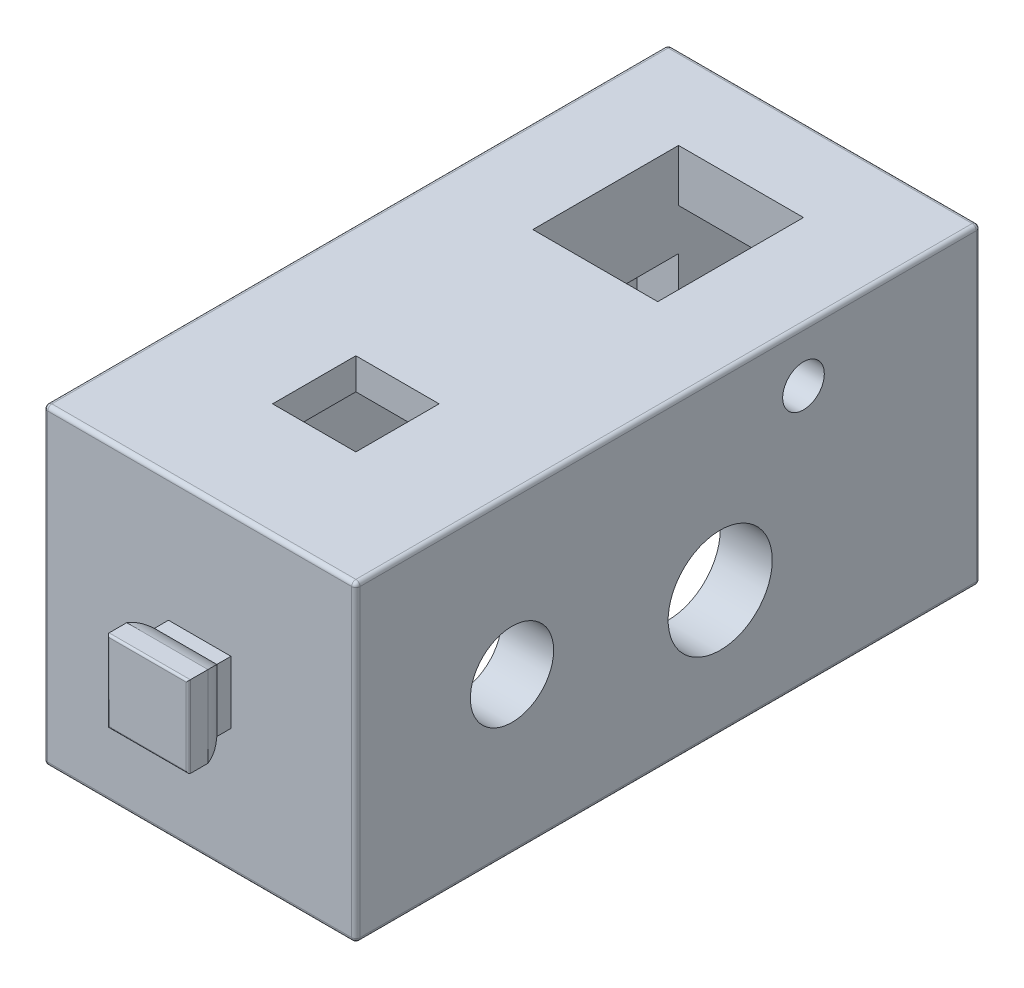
ISO-10303-21;
HEADER;
FILE_DESCRIPTION(('STEP AP214'),'2;1');
FILE_NAME('part.step','',(''),(''),'','','');
FILE_SCHEMA(('AUTOMOTIVE_DESIGN { 1 0 10303 214 1 1 1 1 }'));
ENDSEC;
DATA;
#1=APPLICATION_CONTEXT('core data for automotive mechanical design processes');
#2=APPLICATION_PROTOCOL_DEFINITION('international standard','automotive_design',2000,#1);
#3=PRODUCT_CONTEXT('',#1,'mechanical');
#4=PRODUCT('Part','Part','',(#3));
#5=PRODUCT_RELATED_PRODUCT_CATEGORY('part','',(#4));
#6=PRODUCT_DEFINITION_FORMATION('','',#4);
#7=PRODUCT_DEFINITION_CONTEXT('part definition',#1,'design');
#8=PRODUCT_DEFINITION('design','',#6,#7);
#9=PRODUCT_DEFINITION_SHAPE('','',#8);
#10=(LENGTH_UNIT() NAMED_UNIT(*) SI_UNIT(.MILLI.,.METRE.));
#11=(NAMED_UNIT(*) PLANE_ANGLE_UNIT() SI_UNIT($,.RADIAN.));
#12=(NAMED_UNIT(*) SI_UNIT($,.STERADIAN.) SOLID_ANGLE_UNIT());
#13=UNCERTAINTY_MEASURE_WITH_UNIT(LENGTH_MEASURE(1.E-05),#10,'distance_accuracy_value','');
#14=(GEOMETRIC_REPRESENTATION_CONTEXT(3) GLOBAL_UNCERTAINTY_ASSIGNED_CONTEXT((#13)) GLOBAL_UNIT_ASSIGNED_CONTEXT((#10,
#11,#12)) REPRESENTATION_CONTEXT('',''));
#15=CARTESIAN_POINT('',(0.,0.,0.));
#16=DIRECTION('',(0.,0.,1.));
#17=DIRECTION('',(1.,0.,0.));
#18=AXIS2_PLACEMENT_3D('',#15,#16,#17);
#19=CARTESIAN_POINT('',(3.,13.5,-26.));
#20=DIRECTION('',(1.,0.,0.));
#21=DIRECTION('',(0.,0.,-1.));
#22=AXIS2_PLACEMENT_3D('',#19,#20,#21);
#23=PLANE('',#22);
#24=CARTESIAN_POINT('',(3.,12.5,-21.5));
#25=DIRECTION('',(1.,0.,0.));
#26=DIRECTION('',(0.,0.,-1.));
#27=AXIS2_PLACEMENT_3D('',#24,#25,#26);
#28=CIRCLE('',#27,1.);
#29=CARTESIAN_POINT('',(3.,12.5,-22.5));
#30=VERTEX_POINT('',#29);
#31=EDGE_CURVE('E1209',#30,#30,#28,.F.);
#32=ORIENTED_EDGE('',*,*,#31,.F.);
#33=EDGE_LOOP('',(#32));
#34=FACE_BOUND('',#33,.T.);
#35=DIRECTION('',(0.,-1.,0.));
#36=VECTOR('',#35,1.);
#37=CARTESIAN_POINT('',(3.,13.5,-30.));
#38=LINE('',#37,#36);
#39=CARTESIAN_POINT('',(3.,12.5,-30.));
#40=VERTEX_POINT('',#39);
#41=CARTESIAN_POINT('',(3.,0.200000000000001,-30.));
#42=VERTEX_POINT('',#41);
#43=EDGE_CURVE('E563',#40,#42,#38,.T.);
#44=ORIENTED_EDGE('',*,*,#43,.T.);
#45=CARTESIAN_POINT('',(3.,0.2,-29.8));
#46=DIRECTION('',(1.,0.,0.));
#47=DIRECTION('',(0.,0.,-1.));
#48=AXIS2_PLACEMENT_3D('',#45,#46,#47);
#49=CIRCLE('',#48,0.2);
#50=CARTESIAN_POINT('',(3.,0.,-29.8));
#51=VERTEX_POINT('',#50);
#52=EDGE_CURVE('E716',#42,#51,#49,.F.);
#53=ORIENTED_EDGE('',*,*,#52,.T.);
#54=DIRECTION('',(0.,0.,1.));
#55=VECTOR('',#54,1.);
#56=CARTESIAN_POINT('',(3.,0.,-26.));
#57=LINE('',#56,#55);
#58=CARTESIAN_POINT('',(3.,0.,-26.));
#59=VERTEX_POINT('',#58);
#60=EDGE_CURVE('E543',#51,#59,#57,.T.);
#61=ORIENTED_EDGE('',*,*,#60,.T.);
#62=DIRECTION('',(0.,-1.,0.));
#63=VECTOR('',#62,1.);
#64=CARTESIAN_POINT('',(3.,13.5,-26.));
#65=LINE('',#64,#63);
#66=CARTESIAN_POINT('',(3.,10.5,-26.));
#67=VERTEX_POINT('',#66);
#68=EDGE_CURVE('E560',#67,#59,#65,.T.);
#69=ORIENTED_EDGE('',*,*,#68,.F.);
#70=DIRECTION('',(0.,0.,1.));
#71=VECTOR('',#70,1.);
#72=CARTESIAN_POINT('',(3.,10.5,-19.));
#73=LINE('',#72,#71);
#74=CARTESIAN_POINT('',(3.,10.5,-19.));
#75=VERTEX_POINT('',#74);
#76=EDGE_CURVE('E482',#67,#75,#73,.T.);
#77=ORIENTED_EDGE('',*,*,#76,.T.);
#78=DIRECTION('',(0.,-1.,0.));
#79=VECTOR('',#78,1.);
#80=CARTESIAN_POINT('',(3.,15.,-19.));
#81=LINE('',#80,#79);
#82=CARTESIAN_POINT('',(3.,15.,-19.));
#83=VERTEX_POINT('',#82);
#84=EDGE_CURVE('E490',#83,#75,#81,.T.);
#85=ORIENTED_EDGE('',*,*,#84,.F.);
#86=DIRECTION('',(0.,0.,1.));
#87=VECTOR('',#86,1.);
#88=CARTESIAN_POINT('',(3.,15.,-19.));
#89=LINE('',#88,#87);
#90=CARTESIAN_POINT('',(3.,15.,-26.));
#91=VERTEX_POINT('',#90);
#92=EDGE_CURVE('E474',#91,#83,#89,.T.);
#93=ORIENTED_EDGE('',*,*,#92,.F.);
#94=DIRECTION('',(0.,-1.,0.));
#95=VECTOR('',#94,1.);
#96=CARTESIAN_POINT('',(3.,15.,-26.));
#97=LINE('',#96,#95);
#98=CARTESIAN_POINT('',(3.,12.5,-26.));
#99=VERTEX_POINT('',#98);
#100=EDGE_CURVE('E492',#91,#99,#97,.T.);
#101=ORIENTED_EDGE('',*,*,#100,.T.);
#102=DIRECTION('',(0.,0.,1.));
#103=VECTOR('',#102,1.);
#104=CARTESIAN_POINT('',(3.,12.5,-30.));
#105=LINE('',#104,#103);
#106=EDGE_CURVE('E501',#40,#99,#105,.T.);
#107=ORIENTED_EDGE('',*,*,#106,.F.);
#108=EDGE_LOOP('',(#44,#53,#61,#69,#77,#85,#93,#101,#107));
#109=FACE_BOUND('',#108,.T.);
#110=ADVANCED_FACE('F39',(#34,#109),#23,.F.);
#111=CARTESIAN_POINT('',(-3.,13.5,-26.));
#112=DIRECTION('',(-1.,0.,0.));
#113=DIRECTION('',(0.,0.,1.));
#114=AXIS2_PLACEMENT_3D('',#111,#112,#113);
#115=PLANE('',#114);
#116=DIRECTION('',(0.,0.,-1.));
#117=VECTOR('',#116,1.);
#118=CARTESIAN_POINT('',(-3.,0.,-26.));
#119=LINE('',#118,#117);
#120=CARTESIAN_POINT('',(-3.,0.,-26.));
#121=VERTEX_POINT('',#120);
#122=CARTESIAN_POINT('',(-3.,0.,-29.8));
#123=VERTEX_POINT('',#122);
#124=EDGE_CURVE('E540',#121,#123,#119,.T.);
#125=ORIENTED_EDGE('',*,*,#124,.T.);
#126=CARTESIAN_POINT('',(-3.,0.2,-29.8));
#127=DIRECTION('',(-1.,0.,0.));
#128=DIRECTION('',(0.,0.,1.));
#129=AXIS2_PLACEMENT_3D('',#126,#127,#128);
#130=CIRCLE('',#129,0.2);
#131=CARTESIAN_POINT('',(-3.,0.200000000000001,-30.));
#132=VERTEX_POINT('',#131);
#133=EDGE_CURVE('E714',#123,#132,#130,.F.);
#134=ORIENTED_EDGE('',*,*,#133,.T.);
#135=DIRECTION('',(0.,-1.,0.));
#136=VECTOR('',#135,1.);
#137=CARTESIAN_POINT('',(-3.,13.5,-30.));
#138=LINE('',#137,#136);
#139=CARTESIAN_POINT('',(-3.,12.5,-30.));
#140=VERTEX_POINT('',#139);
#141=EDGE_CURVE('E566',#140,#132,#138,.T.);
#142=ORIENTED_EDGE('',*,*,#141,.F.);
#143=DIRECTION('',(0.,0.,-1.));
#144=VECTOR('',#143,1.);
#145=CARTESIAN_POINT('',(-3.,12.5,-30.));
#146=LINE('',#145,#144);
#147=CARTESIAN_POINT('',(-3.,12.5,-26.));
#148=VERTEX_POINT('',#147);
#149=EDGE_CURVE('E489',#148,#140,#146,.T.);
#150=ORIENTED_EDGE('',*,*,#149,.F.);
#151=DIRECTION('',(0.,-1.,0.));
#152=VECTOR('',#151,1.);
#153=CARTESIAN_POINT('',(-3.,15.,-26.));
#154=LINE('',#153,#152);
#155=CARTESIAN_POINT('',(-3.,15.,-26.));
#156=VERTEX_POINT('',#155);
#157=EDGE_CURVE('E480',#156,#148,#154,.T.);
#158=ORIENTED_EDGE('',*,*,#157,.F.);
#159=DIRECTION('',(0.,0.,-1.));
#160=VECTOR('',#159,1.);
#161=CARTESIAN_POINT('',(-3.,15.,-19.));
#162=LINE('',#161,#160);
#163=CARTESIAN_POINT('',(-3.,15.,-19.));
#164=VERTEX_POINT('',#163);
#165=EDGE_CURVE('E467',#164,#156,#162,.T.);
#166=ORIENTED_EDGE('',*,*,#165,.F.);
#167=DIRECTION('',(0.,-1.,0.));
#168=VECTOR('',#167,1.);
#169=CARTESIAN_POINT('',(-3.,15.,-19.));
#170=LINE('',#169,#168);
#171=CARTESIAN_POINT('',(-3.,10.5,-19.));
#172=VERTEX_POINT('',#171);
#173=EDGE_CURVE('E487',#164,#172,#170,.T.);
#174=ORIENTED_EDGE('',*,*,#173,.T.);
#175=DIRECTION('',(0.,0.,-1.));
#176=VECTOR('',#175,1.);
#177=CARTESIAN_POINT('',(-3.,10.5,-19.));
#178=LINE('',#177,#176);
#179=CARTESIAN_POINT('',(-3.,10.5,-26.));
#180=VERTEX_POINT('',#179);
#181=EDGE_CURVE('E464',#172,#180,#178,.T.);
#182=ORIENTED_EDGE('',*,*,#181,.T.);
#183=DIRECTION('',(0.,-1.,0.));
#184=VECTOR('',#183,1.);
#185=CARTESIAN_POINT('',(-3.,13.5,-26.));
#186=LINE('',#185,#184);
#187=EDGE_CURVE('E569',#180,#121,#186,.T.);
#188=ORIENTED_EDGE('',*,*,#187,.T.);
#189=EDGE_LOOP('',(#125,#134,#142,#150,#158,#166,#174,#182,#188));
#190=FACE_BOUND('',#189,.T.);
#191=ADVANCED_FACE('F901',(#190),#115,.F.);
#192=CARTESIAN_POINT('',(-5.,13.5,-1.5));
#193=DIRECTION('',(-1.,0.,0.));
#194=DIRECTION('',(0.,0.,1.));
#195=AXIS2_PLACEMENT_3D('',#192,#193,#194);
#196=PLANE('',#195);
#197=CARTESIAN_POINT('',(-5.,6.,-17.5));
#198=DIRECTION('',(1.,0.,0.));
#199=DIRECTION('',(0.,0.,-1.));
#200=AXIS2_PLACEMENT_3D('',#197,#198,#199);
#201=CIRCLE('',#200,1.25);
#202=CARTESIAN_POINT('',(-5.,6.,-18.75));
#203=VERTEX_POINT('',#202);
#204=EDGE_CURVE('E1226',#203,#203,#201,.T.);
#205=ORIENTED_EDGE('',*,*,#204,.F.);
#206=EDGE_LOOP('',(#205));
#207=FACE_BOUND('',#206,.T.);
#208=CARTESIAN_POINT('',(-5.,7.5,-7.5));
#209=DIRECTION('',(1.,0.,0.));
#210=DIRECTION('',(0.,0.,-1.));
#211=AXIS2_PLACEMENT_3D('',#208,#209,#210);
#212=CIRCLE('',#211,2.);
#213=CARTESIAN_POINT('',(-5.,7.5,-9.5));
#214=VERTEX_POINT('',#213);
#215=EDGE_CURVE('E1214',#214,#214,#212,.T.);
#216=ORIENTED_EDGE('',*,*,#215,.F.);
#217=EDGE_LOOP('',(#216));
#218=FACE_BOUND('',#217,.T.);
#219=DIRECTION('',(0.,1.,0.));
#220=VECTOR('',#219,1.);
#221=CARTESIAN_POINT('',(-5.,10.5,-17.5));
#222=LINE('',#221,#220);
#223=CARTESIAN_POINT('',(-5.,10.5,-17.5));
#224=VERTEX_POINT('',#223);
#225=CARTESIAN_POINT('',(-5.,13.5,-17.5));
#226=VERTEX_POINT('',#225);
#227=EDGE_CURVE('E518',#224,#226,#222,.T.);
#228=ORIENTED_EDGE('',*,*,#227,.T.);
#229=DIRECTION('',(0.,0.,-1.));
#230=VECTOR('',#229,1.);
#231=CARTESIAN_POINT('',(-5.,13.5,-1.5));
#232=LINE('',#231,#230);
#233=CARTESIAN_POINT('',(-5.,13.5,-1.5));
#234=VERTEX_POINT('',#233);
#235=EDGE_CURVE('E525',#234,#226,#232,.T.);
#236=ORIENTED_EDGE('',*,*,#235,.F.);
#237=DIRECTION('',(0.,-1.,0.));
#238=VECTOR('',#237,1.);
#239=CARTESIAN_POINT('',(-5.,13.5,-1.5));
#240=LINE('',#239,#238);
#241=CARTESIAN_POINT('',(-5.,0.,-1.5));
#242=VERTEX_POINT('',#241);
#243=EDGE_CURVE('E553',#234,#242,#240,.T.);
#244=ORIENTED_EDGE('',*,*,#243,.T.);
#245=DIRECTION('',(0.,0.,-1.));
#246=VECTOR('',#245,1.);
#247=CARTESIAN_POINT('',(-5.,0.,-1.5));
#248=LINE('',#247,#246);
#249=CARTESIAN_POINT('',(-5.,0.,-26.));
#250=VERTEX_POINT('',#249);
#251=EDGE_CURVE('E524',#242,#250,#248,.T.);
#252=ORIENTED_EDGE('',*,*,#251,.T.);
#253=DIRECTION('',(0.,-1.,0.));
#254=VECTOR('',#253,1.);
#255=CARTESIAN_POINT('',(-5.,13.5,-26.));
#256=LINE('',#255,#254);
#257=CARTESIAN_POINT('',(-5.,10.5,-26.));
#258=VERTEX_POINT('',#257);
#259=EDGE_CURVE('E534',#258,#250,#256,.T.);
#260=ORIENTED_EDGE('',*,*,#259,.F.);
#261=DIRECTION('',(0.,0.,-1.));
#262=VECTOR('',#261,1.);
#263=CARTESIAN_POINT('',(-5.,10.5,-17.5));
#264=LINE('',#263,#262);
#265=EDGE_CURVE('E508',#224,#258,#264,.T.);
#266=ORIENTED_EDGE('',*,*,#265,.F.);
#267=EDGE_LOOP('',(#228,#236,#244,#252,#260,#266));
#268=FACE_BOUND('',#267,.T.);
#269=ADVANCED_FACE('F891',(#207,#218,#268),#196,.F.);
#270=CARTESIAN_POINT('',(5.,13.5,-1.5));
#271=DIRECTION('',(1.,0.,0.));
#272=DIRECTION('',(0.,0.,-1.));
#273=AXIS2_PLACEMENT_3D('',#270,#271,#272);
#274=PLANE('',#273);
#275=CARTESIAN_POINT('',(5.,7.5,-7.5));
#276=DIRECTION('',(1.,0.,0.));
#277=DIRECTION('',(0.,0.,-1.));
#278=AXIS2_PLACEMENT_3D('',#275,#276,#277);
#279=CIRCLE('',#278,2.);
#280=CARTESIAN_POINT('',(5.,7.5,-9.5));
#281=VERTEX_POINT('',#280);
#282=EDGE_CURVE('E1196',#281,#281,#279,.F.);
#283=ORIENTED_EDGE('',*,*,#282,.F.);
#284=EDGE_LOOP('',(#283));
#285=FACE_BOUND('',#284,.T.);
#286=CARTESIAN_POINT('',(5.,6.,-17.5));
#287=DIRECTION('',(1.,0.,0.));
#288=DIRECTION('',(0.,0.,-1.));
#289=AXIS2_PLACEMENT_3D('',#286,#287,#288);
#290=CIRCLE('',#289,2.5);
#291=CARTESIAN_POINT('',(5.,6.,-20.));
#292=VERTEX_POINT('',#291);
#293=EDGE_CURVE('E1199',#292,#292,#290,.F.);
#294=ORIENTED_EDGE('',*,*,#293,.F.);
#295=EDGE_LOOP('',(#294));
#296=FACE_BOUND('',#295,.T.);
#297=DIRECTION('',(0.,1.,0.));
#298=VECTOR('',#297,1.);
#299=CARTESIAN_POINT('',(5.,10.5,-17.5));
#300=LINE('',#299,#298);
#301=CARTESIAN_POINT('',(5.,10.5,-17.5));
#302=VERTEX_POINT('',#301);
#303=CARTESIAN_POINT('',(5.,13.5,-17.5));
#304=VERTEX_POINT('',#303);
#305=EDGE_CURVE('E522',#302,#304,#300,.T.);
#306=ORIENTED_EDGE('',*,*,#305,.F.);
#307=DIRECTION('',(0.,0.,1.));
#308=VECTOR('',#307,1.);
#309=CARTESIAN_POINT('',(5.,10.5,-17.5));
#310=LINE('',#309,#308);
#311=CARTESIAN_POINT('',(5.,10.5,-26.));
#312=VERTEX_POINT('',#311);
#313=EDGE_CURVE('E514',#312,#302,#310,.T.);
#314=ORIENTED_EDGE('',*,*,#313,.F.);
#315=DIRECTION('',(0.,-1.,0.));
#316=VECTOR('',#315,1.);
#317=CARTESIAN_POINT('',(5.,13.5,-26.));
#318=LINE('',#317,#316);
#319=CARTESIAN_POINT('',(5.,0.,-26.));
#320=VERTEX_POINT('',#319);
#321=EDGE_CURVE('E558',#312,#320,#318,.T.);
#322=ORIENTED_EDGE('',*,*,#321,.T.);
#323=DIRECTION('',(0.,0.,1.));
#324=VECTOR('',#323,1.);
#325=CARTESIAN_POINT('',(5.,0.,-1.5));
#326=LINE('',#325,#324);
#327=CARTESIAN_POINT('',(5.,0.,-1.5));
#328=VERTEX_POINT('',#327);
#329=EDGE_CURVE('E548',#320,#328,#326,.T.);
#330=ORIENTED_EDGE('',*,*,#329,.T.);
#331=DIRECTION('',(0.,-1.,0.));
#332=VECTOR('',#331,1.);
#333=CARTESIAN_POINT('',(5.,13.5,-1.5));
#334=LINE('',#333,#332);
#335=CARTESIAN_POINT('',(5.,13.5,-1.5));
#336=VERTEX_POINT('',#335);
#337=EDGE_CURVE('E556',#336,#328,#334,.T.);
#338=ORIENTED_EDGE('',*,*,#337,.F.);
#339=DIRECTION('',(0.,0.,1.));
#340=VECTOR('',#339,1.);
#341=CARTESIAN_POINT('',(5.,13.5,-1.5));
#342=LINE('',#341,#340);
#343=EDGE_CURVE('E528',#304,#336,#342,.T.);
#344=ORIENTED_EDGE('',*,*,#343,.F.);
#345=EDGE_LOOP('',(#306,#314,#322,#330,#338,#344));
#346=FACE_BOUND('',#345,.T.);
#347=ADVANCED_FACE('F881',(#285,#296,#346),#274,.F.);
#348=CARTESIAN_POINT('',(-5.,13.5,-26.));
#349=DIRECTION('',(0.,-1.,0.));
#350=DIRECTION('',(0.,0.,-1.));
#351=AXIS2_PLACEMENT_3D('',#348,#349,#350);
#352=PLANE('',#351);
#353=DIRECTION('',(0.,0.,1.));
#354=VECTOR('',#353,1.);
#355=CARTESIAN_POINT('',(-2.,13.5,-5.5));
#356=LINE('',#355,#354);
#357=CARTESIAN_POINT('',(-2.,13.5,-9.5));
#358=VERTEX_POINT('',#357);
#359=CARTESIAN_POINT('',(-2.,13.5,-5.5));
#360=VERTEX_POINT('',#359);
#361=EDGE_CURVE('E394',#358,#360,#356,.T.);
#362=ORIENTED_EDGE('',*,*,#361,.T.);
#363=DIRECTION('',(1.,0.,0.));
#364=VECTOR('',#363,1.);
#365=CARTESIAN_POINT('',(-2.,13.5,-5.5));
#366=LINE('',#365,#364);
#367=CARTESIAN_POINT('',(2.,13.5,-5.5));
#368=VERTEX_POINT('',#367);
#369=EDGE_CURVE('E378',#360,#368,#366,.T.);
#370=ORIENTED_EDGE('',*,*,#369,.T.);
#371=DIRECTION('',(0.,0.,-1.));
#372=VECTOR('',#371,1.);
#373=CARTESIAN_POINT('',(2.,13.5,-5.5));
#374=LINE('',#373,#372);
#375=CARTESIAN_POINT('',(2.,13.5,-9.5));
#376=VERTEX_POINT('',#375);
#377=EDGE_CURVE('E407',#368,#376,#374,.T.);
#378=ORIENTED_EDGE('',*,*,#377,.T.);
#379=DIRECTION('',(-1.,0.,0.));
#380=VECTOR('',#379,1.);
#381=CARTESIAN_POINT('',(-2.,13.5,-9.5));
#382=LINE('',#381,#380);
#383=EDGE_CURVE('E403',#376,#358,#382,.T.);
#384=ORIENTED_EDGE('',*,*,#383,.T.);
#385=EDGE_LOOP('',(#362,#370,#378,#384));
#386=FACE_BOUND('',#385,.T.);
#387=ORIENTED_EDGE('',*,*,#235,.T.);
#388=DIRECTION('',(-1.,0.,0.));
#389=VECTOR('',#388,1.);
#390=CARTESIAN_POINT('',(-5.,13.5,-17.5));
#391=LINE('',#390,#389);
#392=EDGE_CURVE('E507',#304,#226,#391,.T.);
#393=ORIENTED_EDGE('',*,*,#392,.F.);
#394=ORIENTED_EDGE('',*,*,#343,.T.);
#395=DIRECTION('',(-1.,0.,0.));
#396=VECTOR('',#395,1.);
#397=CARTESIAN_POINT('',(-5.,13.5,-1.5));
#398=LINE('',#397,#396);
#399=EDGE_CURVE('E531',#336,#234,#398,.T.);
#400=ORIENTED_EDGE('',*,*,#399,.T.);
#401=EDGE_LOOP('',(#387,#393,#394,#400));
#402=FACE_BOUND('',#401,.T.);
#403=ADVANCED_FACE('F401',(#386,#402),#352,.T.);
#404=CARTESIAN_POINT('',(-7.5,15.,0.));
#405=DIRECTION('',(0.,0.,-1.));
#406=DIRECTION('',(-1.,0.,0.));
#407=AXIS2_PLACEMENT_3D('',#404,#405,#406);
#408=PLANE('',#407);
#409=DIRECTION('',(-1.,0.,0.));
#410=VECTOR('',#409,1.);
#411=CARTESIAN_POINT('',(-7.5,14.8,0.));
#412=LINE('',#411,#410);
#413=CARTESIAN_POINT('',(7.3,14.8,0.));
#414=VERTEX_POINT('',#413);
#415=CARTESIAN_POINT('',(-7.3,14.8,0.));
#416=VERTEX_POINT('',#415);
#417=EDGE_CURVE('E727',#414,#416,#412,.T.);
#418=ORIENTED_EDGE('',*,*,#417,.T.);
#419=DIRECTION('',(0.,-1.,0.));
#420=VECTOR('',#419,1.);
#421=CARTESIAN_POINT('',(-7.3,0.,0.));
#422=LINE('',#421,#420);
#423=CARTESIAN_POINT('',(-7.3,0.200000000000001,0.));
#424=VERTEX_POINT('',#423);
#425=EDGE_CURVE('E733',#416,#424,#422,.T.);
#426=ORIENTED_EDGE('',*,*,#425,.T.);
#427=DIRECTION('',(1.,0.,0.));
#428=VECTOR('',#427,1.);
#429=CARTESIAN_POINT('',(7.5,0.200000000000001,0.));
#430=LINE('',#429,#428);
#431=CARTESIAN_POINT('',(7.3,0.200000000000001,0.));
#432=VERTEX_POINT('',#431);
#433=EDGE_CURVE('E731',#424,#432,#430,.T.);
#434=ORIENTED_EDGE('',*,*,#433,.T.);
#435=DIRECTION('',(0.,1.,0.));
#436=VECTOR('',#435,1.);
#437=CARTESIAN_POINT('',(7.3,15.,0.));
#438=LINE('',#437,#436);
#439=EDGE_CURVE('E729',#432,#414,#438,.T.);
#440=ORIENTED_EDGE('',*,*,#439,.T.);
#441=EDGE_LOOP('',(#418,#426,#434,#440));
#442=FACE_BOUND('',#441,.T.);
#443=DIRECTION('',(0.,-1.,0.));
#444=VECTOR('',#443,1.);
#445=CARTESIAN_POINT('',(-1.5,6.,0.));
#446=LINE('',#445,#444);
#447=CARTESIAN_POINT('',(-1.5,9.,0.));
#448=VERTEX_POINT('',#447);
#449=CARTESIAN_POINT('',(-1.5,6.,0.));
#450=VERTEX_POINT('',#449);
#451=EDGE_CURVE('E616',#448,#450,#446,.T.);
#452=ORIENTED_EDGE('',*,*,#451,.F.);
#453=DIRECTION('',(-1.,0.,0.));
#454=VECTOR('',#453,1.);
#455=CARTESIAN_POINT('',(-1.5,9.,0.));
#456=LINE('',#455,#454);
#457=CARTESIAN_POINT('',(1.5,9.,0.));
#458=VERTEX_POINT('',#457);
#459=EDGE_CURVE('E625',#458,#448,#456,.T.);
#460=ORIENTED_EDGE('',*,*,#459,.F.);
#461=DIRECTION('',(0.,1.,0.));
#462=VECTOR('',#461,1.);
#463=CARTESIAN_POINT('',(1.5,6.,0.));
#464=LINE('',#463,#462);
#465=CARTESIAN_POINT('',(1.5,6.,0.));
#466=VERTEX_POINT('',#465);
#467=EDGE_CURVE('E622',#466,#458,#464,.T.);
#468=ORIENTED_EDGE('',*,*,#467,.F.);
#469=DIRECTION('',(1.,0.,0.));
#470=VECTOR('',#469,1.);
#471=CARTESIAN_POINT('',(-1.5,6.,0.));
#472=LINE('',#471,#470);
#473=EDGE_CURVE('E619',#450,#466,#472,.T.);
#474=ORIENTED_EDGE('',*,*,#473,.F.);
#475=EDGE_LOOP('',(#452,#460,#468,#474));
#476=FACE_BOUND('',#475,.T.);
#477=ADVANCED_FACE('F1027',(#442,#476),#408,.F.);
#478=CARTESIAN_POINT('',(-7.5,0.,-30.));
#479=DIRECTION('',(-1.,0.,0.));
#480=DIRECTION('',(0.,0.,1.));
#481=AXIS2_PLACEMENT_3D('',#478,#479,#480);
#482=PLANE('',#481);
#483=DIRECTION('',(0.,-1.,0.));
#484=VECTOR('',#483,1.);
#485=CARTESIAN_POINT('',(-7.5,0.,-29.8));
#486=LINE('',#485,#484);
#487=CARTESIAN_POINT('',(-7.5,14.8,-29.8));
#488=VERTEX_POINT('',#487);
#489=CARTESIAN_POINT('',(-7.5,0.2,-29.8));
#490=VERTEX_POINT('',#489);
#491=EDGE_CURVE('E722',#488,#490,#486,.T.);
#492=ORIENTED_EDGE('',*,*,#491,.T.);
#493=DIRECTION('',(0.,0.,1.));
#494=VECTOR('',#493,1.);
#495=CARTESIAN_POINT('',(-7.5,0.2,-30.));
#496=LINE('',#495,#494);
#497=CARTESIAN_POINT('',(-7.5,0.2,-0.2));
#498=VERTEX_POINT('',#497);
#499=EDGE_CURVE('E724',#490,#498,#496,.T.);
#500=ORIENTED_EDGE('',*,*,#499,.T.);
#501=DIRECTION('',(0.,-1.,0.));
#502=VECTOR('',#501,1.);
#503=CARTESIAN_POINT('',(-7.5,15.,-0.2));
#504=LINE('',#503,#502);
#505=CARTESIAN_POINT('',(-7.5,14.8,-0.2));
#506=VERTEX_POINT('',#505);
#507=EDGE_CURVE('E720',#498,#506,#504,.F.);
#508=ORIENTED_EDGE('',*,*,#507,.T.);
#509=DIRECTION('',(0.,0.,1.));
#510=VECTOR('',#509,1.);
#511=CARTESIAN_POINT('',(-7.5,14.8,-30.));
#512=LINE('',#511,#510);
#513=EDGE_CURVE('E718',#506,#488,#512,.F.);
#514=ORIENTED_EDGE('',*,*,#513,.T.);
#515=EDGE_LOOP('',(#492,#500,#508,#514));
#516=FACE_BOUND('',#515,.T.);
#517=CARTESIAN_POINT('',(-7.5,6.,-17.5));
#518=DIRECTION('',(-1.,0.,0.));
#519=DIRECTION('',(0.,0.,1.));
#520=AXIS2_PLACEMENT_3D('',#517,#518,#519);
#521=CIRCLE('',#520,1.25);
#522=CARTESIAN_POINT('',(-7.5,6.,-16.25));
#523=VERTEX_POINT('',#522);
#524=EDGE_CURVE('E831',#523,#523,#521,.F.);
#525=ORIENTED_EDGE('',*,*,#524,.T.);
#526=EDGE_LOOP('',(#525));
#527=FACE_BOUND('',#526,.T.);
#528=CARTESIAN_POINT('',(-7.5,12.5,-21.5));
#529=DIRECTION('',(-1.,0.,0.));
#530=DIRECTION('',(0.,0.,1.));
#531=AXIS2_PLACEMENT_3D('',#528,#529,#530);
#532=CIRCLE('',#531,1.);
#533=CARTESIAN_POINT('',(-7.5,12.5,-20.5));
#534=VERTEX_POINT('',#533);
#535=EDGE_CURVE('E1223',#534,#534,#532,.F.);
#536=ORIENTED_EDGE('',*,*,#535,.T.);
#537=EDGE_LOOP('',(#536));
#538=FACE_BOUND('',#537,.T.);
#539=CARTESIAN_POINT('',(-7.5,7.5,-7.5));
#540=DIRECTION('',(-1.,0.,0.));
#541=DIRECTION('',(0.,0.,1.));
#542=AXIS2_PLACEMENT_3D('',#539,#540,#541);
#543=CIRCLE('',#542,2.);
#544=CARTESIAN_POINT('',(-7.5,7.5,-5.5));
#545=VERTEX_POINT('',#544);
#546=EDGE_CURVE('E1217',#545,#545,#543,.F.);
#547=ORIENTED_EDGE('',*,*,#546,.T.);
#548=EDGE_LOOP('',(#547));
#549=FACE_BOUND('',#548,.T.);
#550=ADVANCED_FACE('F1030',(#516,#527,#538,#549),#482,.T.);
#551=CARTESIAN_POINT('',(-7.5,15.,-30.));
#552=DIRECTION('',(0.,1.,0.));
#553=DIRECTION('',(0.,0.,1.));
#554=AXIS2_PLACEMENT_3D('',#551,#552,#553);
#555=PLANE('',#554);
#556=DIRECTION('',(0.,0.,1.));
#557=VECTOR('',#556,1.);
#558=CARTESIAN_POINT('',(7.3,15.,-30.));
#559=LINE('',#558,#557);
#560=CARTESIAN_POINT('',(7.3,15.,-0.2));
#561=VERTEX_POINT('',#560);
#562=CARTESIAN_POINT('',(7.3,15.,-29.8));
#563=VERTEX_POINT('',#562);
#564=EDGE_CURVE('E64',#561,#563,#559,.F.);
#565=ORIENTED_EDGE('',*,*,#564,.T.);
#566=DIRECTION('',(-1.,0.,0.));
#567=VECTOR('',#566,1.);
#568=CARTESIAN_POINT('',(-7.5,15.,-29.8));
#569=LINE('',#568,#567);
#570=CARTESIAN_POINT('',(-7.3,15.,-29.8));
#571=VERTEX_POINT('',#570);
#572=EDGE_CURVE('E750',#563,#571,#569,.T.);
#573=ORIENTED_EDGE('',*,*,#572,.T.);
#574=DIRECTION('',(0.,0.,1.));
#575=VECTOR('',#574,1.);
#576=CARTESIAN_POINT('',(-7.3,15.,-30.));
#577=LINE('',#576,#575);
#578=CARTESIAN_POINT('',(-7.3,15.,-0.2));
#579=VERTEX_POINT('',#578);
#580=EDGE_CURVE('E748',#571,#579,#577,.T.);
#581=ORIENTED_EDGE('',*,*,#580,.T.);
#582=DIRECTION('',(-1.,0.,0.));
#583=VECTOR('',#582,1.);
#584=CARTESIAN_POINT('',(7.5,15.,-0.2));
#585=LINE('',#584,#583);
#586=EDGE_CURVE('E745',#579,#561,#585,.F.);
#587=ORIENTED_EDGE('',*,*,#586,.T.);
#588=EDGE_LOOP('',(#565,#573,#581,#587));
#589=FACE_BOUND('',#588,.T.);
#590=DIRECTION('',(0.,0.,1.));
#591=VECTOR('',#590,1.);
#592=CARTESIAN_POINT('',(-2.,15.,-5.5));
#593=LINE('',#592,#591);
#594=CARTESIAN_POINT('',(-2.,15.,-9.5));
#595=VERTEX_POINT('',#594);
#596=CARTESIAN_POINT('',(-2.,15.,-5.5));
#597=VERTEX_POINT('',#596);
#598=EDGE_CURVE('E397',#595,#597,#593,.T.);
#599=ORIENTED_EDGE('',*,*,#598,.F.);
#600=DIRECTION('',(-1.,0.,0.));
#601=VECTOR('',#600,1.);
#602=CARTESIAN_POINT('',(-2.,15.,-9.5));
#603=LINE('',#602,#601);
#604=CARTESIAN_POINT('',(2.,15.,-9.5));
#605=VERTEX_POINT('',#604);
#606=EDGE_CURVE('E398',#605,#595,#603,.T.);
#607=ORIENTED_EDGE('',*,*,#606,.F.);
#608=DIRECTION('',(0.,0.,-1.));
#609=VECTOR('',#608,1.);
#610=CARTESIAN_POINT('',(2.,15.,-5.5));
#611=LINE('',#610,#609);
#612=CARTESIAN_POINT('',(2.,15.,-5.5));
#613=VERTEX_POINT('',#612);
#614=EDGE_CURVE('E412',#613,#605,#611,.T.);
#615=ORIENTED_EDGE('',*,*,#614,.F.);
#616=DIRECTION('',(1.,0.,0.));
#617=VECTOR('',#616,1.);
#618=CARTESIAN_POINT('',(-2.,15.,-5.5));
#619=LINE('',#618,#617);
#620=EDGE_CURVE('E405',#597,#613,#619,.T.);
#621=ORIENTED_EDGE('',*,*,#620,.F.);
#622=EDGE_LOOP('',(#599,#607,#615,#621));
#623=FACE_BOUND('',#622,.T.);
#624=ORIENTED_EDGE('',*,*,#165,.T.);
#625=DIRECTION('',(1.,0.,0.));
#626=VECTOR('',#625,1.);
#627=CARTESIAN_POINT('',(-3.,15.,-26.));
#628=LINE('',#627,#626);
#629=EDGE_CURVE('E470',#156,#91,#628,.T.);
#630=ORIENTED_EDGE('',*,*,#629,.T.);
#631=ORIENTED_EDGE('',*,*,#92,.T.);
#632=DIRECTION('',(-1.,0.,0.));
#633=VECTOR('',#632,1.);
#634=CARTESIAN_POINT('',(-3.,15.,-19.));
#635=LINE('',#634,#633);
#636=EDGE_CURVE('E477',#83,#164,#635,.T.);
#637=ORIENTED_EDGE('',*,*,#636,.T.);
#638=EDGE_LOOP('',(#624,#630,#631,#637));
#639=FACE_BOUND('',#638,.T.);
#640=ADVANCED_FACE('F912',(#589,#623,#639),#555,.T.);
#641=CARTESIAN_POINT('',(7.5,0.,-30.));
#642=DIRECTION('',(1.,0.,0.));
#643=DIRECTION('',(0.,0.,-1.));
#644=AXIS2_PLACEMENT_3D('',#641,#642,#643);
#645=PLANE('',#644);
#646=DIRECTION('',(0.,1.,0.));
#647=VECTOR('',#646,1.);
#648=CARTESIAN_POINT('',(7.5,0.,-0.2));
#649=LINE('',#648,#647);
#650=CARTESIAN_POINT('',(7.5,14.8,-0.2));
#651=VERTEX_POINT('',#650);
#652=CARTESIAN_POINT('',(7.5,0.2,-0.2));
#653=VERTEX_POINT('',#652);
#654=EDGE_CURVE('E738',#651,#653,#649,.F.);
#655=ORIENTED_EDGE('',*,*,#654,.T.);
#656=DIRECTION('',(0.,0.,1.));
#657=VECTOR('',#656,1.);
#658=CARTESIAN_POINT('',(7.5,0.2,-30.));
#659=LINE('',#658,#657);
#660=CARTESIAN_POINT('',(7.5,0.2,-29.8));
#661=VERTEX_POINT('',#660);
#662=EDGE_CURVE('E742',#653,#661,#659,.F.);
#663=ORIENTED_EDGE('',*,*,#662,.T.);
#664=DIRECTION('',(0.,1.,0.));
#665=VECTOR('',#664,1.);
#666=CARTESIAN_POINT('',(7.5,0.,-29.8));
#667=LINE('',#666,#665);
#668=CARTESIAN_POINT('',(7.5,14.8,-29.8));
#669=VERTEX_POINT('',#668);
#670=EDGE_CURVE('E740',#661,#669,#667,.T.);
#671=ORIENTED_EDGE('',*,*,#670,.T.);
#672=DIRECTION('',(0.,0.,1.));
#673=VECTOR('',#672,1.);
#674=CARTESIAN_POINT('',(7.5,14.8,-30.));
#675=LINE('',#674,#673);
#676=EDGE_CURVE('E736',#669,#651,#675,.T.);
#677=ORIENTED_EDGE('',*,*,#676,.T.);
#678=EDGE_LOOP('',(#655,#663,#671,#677));
#679=FACE_BOUND('',#678,.T.);
#680=CARTESIAN_POINT('',(7.5,12.5,-21.5));
#681=DIRECTION('',(1.,0.,0.));
#682=DIRECTION('',(0.,0.,-1.));
#683=AXIS2_PLACEMENT_3D('',#680,#681,#682);
#684=CIRCLE('',#683,1.);
#685=CARTESIAN_POINT('',(7.5,12.5,-22.5));
#686=VERTEX_POINT('',#685);
#687=EDGE_CURVE('E1211',#686,#686,#684,.T.);
#688=ORIENTED_EDGE('',*,*,#687,.F.);
#689=EDGE_LOOP('',(#688));
#690=FACE_BOUND('',#689,.T.);
#691=CARTESIAN_POINT('',(7.5,7.5,-7.5));
#692=DIRECTION('',(1.,0.,0.));
#693=DIRECTION('',(0.,0.,-1.));
#694=AXIS2_PLACEMENT_3D('',#691,#692,#693);
#695=CIRCLE('',#694,2.);
#696=CARTESIAN_POINT('',(7.5,7.5,-9.5));
#697=VERTEX_POINT('',#696);
#698=EDGE_CURVE('E1206',#697,#697,#695,.T.);
#699=ORIENTED_EDGE('',*,*,#698,.F.);
#700=EDGE_LOOP('',(#699));
#701=FACE_BOUND('',#700,.T.);
#702=CARTESIAN_POINT('',(7.5,6.,-17.5));
#703=DIRECTION('',(1.,0.,0.));
#704=DIRECTION('',(0.,0.,-1.));
#705=AXIS2_PLACEMENT_3D('',#702,#703,#704);
#706=CIRCLE('',#705,2.5);
#707=CARTESIAN_POINT('',(7.5,6.,-20.));
#708=VERTEX_POINT('',#707);
#709=EDGE_CURVE('E1201',#708,#708,#706,.T.);
#710=ORIENTED_EDGE('',*,*,#709,.F.);
#711=EDGE_LOOP('',(#710));
#712=FACE_BOUND('',#711,.T.);
#713=ADVANCED_FACE('F1034',(#679,#690,#701,#712),#645,.T.);
#714=CARTESIAN_POINT('',(-7.5,0.,-30.));
#715=DIRECTION('',(0.,-1.,0.));
#716=DIRECTION('',(0.,0.,-1.));
#717=AXIS2_PLACEMENT_3D('',#714,#715,#716);
#718=PLANE('',#717);
#719=DIRECTION('',(0.,0.,1.));
#720=VECTOR('',#719,1.);
#721=CARTESIAN_POINT('',(-4.25,0.,-30.));
#722=LINE('',#721,#720);
#723=CARTESIAN_POINT('',(-4.25,0.,-29.8));
#724=VERTEX_POINT('',#723);
#725=CARTESIAN_POINT('',(-4.25,0.,-29.3614378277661));
#726=VERTEX_POINT('',#725);
#727=EDGE_CURVE('E442',#724,#726,#722,.T.);
#728=ORIENTED_EDGE('',*,*,#727,.F.);
#729=DIRECTION('',(1.,0.,0.));
#730=VECTOR('',#729,1.);
#731=CARTESIAN_POINT('',(-7.5,0.,-29.8));
#732=LINE('',#731,#730);
#733=EDGE_CURVE('E712',#724,#123,#732,.T.);
#734=ORIENTED_EDGE('',*,*,#733,.T.);
#735=ORIENTED_EDGE('',*,*,#124,.F.);
#736=DIRECTION('',(1.,0.,0.));
#737=VECTOR('',#736,1.);
#738=CARTESIAN_POINT('',(-5.,0.,-26.));
#739=LINE('',#738,#737);
#740=EDGE_CURVE('E537',#250,#121,#739,.T.);
#741=ORIENTED_EDGE('',*,*,#740,.F.);
#742=ORIENTED_EDGE('',*,*,#251,.F.);
#743=DIRECTION('',(-1.,0.,0.));
#744=VECTOR('',#743,1.);
#745=CARTESIAN_POINT('',(-5.,0.,-1.5));
#746=LINE('',#745,#744);
#747=EDGE_CURVE('E529',#328,#242,#746,.T.);
#748=ORIENTED_EDGE('',*,*,#747,.F.);
#749=ORIENTED_EDGE('',*,*,#329,.F.);
#750=DIRECTION('',(1.,0.,0.));
#751=VECTOR('',#750,1.);
#752=CARTESIAN_POINT('',(3.,0.,-26.));
#753=LINE('',#752,#751);
#754=EDGE_CURVE('E545',#59,#320,#753,.T.);
#755=ORIENTED_EDGE('',*,*,#754,.F.);
#756=ORIENTED_EDGE('',*,*,#60,.F.);
#757=DIRECTION('',(1.,0.,0.));
#758=VECTOR('',#757,1.);
#759=CARTESIAN_POINT('',(-7.5,0.,-29.8));
#760=LINE('',#759,#758);
#761=CARTESIAN_POINT('',(4.25,0.,-29.8));
#762=VERTEX_POINT('',#761);
#763=EDGE_CURVE('E710',#51,#762,#760,.T.);
#764=ORIENTED_EDGE('',*,*,#763,.T.);
#765=DIRECTION('',(0.,0.,-1.));
#766=VECTOR('',#765,1.);
#767=CARTESIAN_POINT('',(4.25,0.,-30.));
#768=LINE('',#767,#766);
#769=CARTESIAN_POINT('',(4.25,0.,-29.3614378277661));
#770=VERTEX_POINT('',#769);
#771=EDGE_CURVE('E435',#770,#762,#768,.T.);
#772=ORIENTED_EDGE('',*,*,#771,.F.);
#773=CARTESIAN_POINT('',(5.,0.,-28.7));
#774=DIRECTION('',(0.,-1.,0.));
#775=DIRECTION('',(0.,0.,1.));
#776=AXIS2_PLACEMENT_3D('',#773,#774,#775);
#777=CIRCLE('',#776,1.);
#778=CARTESIAN_POINT('',(5.75,0.,-29.3614378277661));
#779=VERTEX_POINT('',#778);
#780=EDGE_CURVE('E389',#779,#770,#777,.T.);
#781=ORIENTED_EDGE('',*,*,#780,.F.);
#782=DIRECTION('',(0.,0.,1.));
#783=VECTOR('',#782,1.);
#784=CARTESIAN_POINT('',(5.75,0.,-30.));
#785=LINE('',#784,#783);
#786=CARTESIAN_POINT('',(5.75,0.,-29.8));
#787=VERTEX_POINT('',#786);
#788=EDGE_CURVE('E425',#787,#779,#785,.T.);
#789=ORIENTED_EDGE('',*,*,#788,.F.);
#790=DIRECTION('',(1.,0.,0.));
#791=VECTOR('',#790,1.);
#792=CARTESIAN_POINT('',(-7.5,0.,-29.8));
#793=LINE('',#792,#791);
#794=CARTESIAN_POINT('',(7.3,0.,-29.8));
#795=VERTEX_POINT('',#794);
#796=EDGE_CURVE('E706',#787,#795,#793,.T.);
#797=ORIENTED_EDGE('',*,*,#796,.T.);
#798=DIRECTION('',(0.,0.,1.));
#799=VECTOR('',#798,1.);
#800=CARTESIAN_POINT('',(7.3,0.,-30.));
#801=LINE('',#800,#799);
#802=CARTESIAN_POINT('',(7.3,0.,-0.2));
#803=VERTEX_POINT('',#802);
#804=EDGE_CURVE('E700',#795,#803,#801,.T.);
#805=ORIENTED_EDGE('',*,*,#804,.T.);
#806=DIRECTION('',(1.,0.,0.));
#807=VECTOR('',#806,1.);
#808=CARTESIAN_POINT('',(-7.5,0.,-0.2));
#809=LINE('',#808,#807);
#810=CARTESIAN_POINT('',(-7.3,0.,-0.2));
#811=VERTEX_POINT('',#810);
#812=EDGE_CURVE('E702',#803,#811,#809,.F.);
#813=ORIENTED_EDGE('',*,*,#812,.T.);
#814=DIRECTION('',(0.,0.,1.));
#815=VECTOR('',#814,1.);
#816=CARTESIAN_POINT('',(-7.3,0.,-30.));
#817=LINE('',#816,#815);
#818=CARTESIAN_POINT('',(-7.3,0.,-29.8));
#819=VERTEX_POINT('',#818);
#820=EDGE_CURVE('E704',#811,#819,#817,.F.);
#821=ORIENTED_EDGE('',*,*,#820,.T.);
#822=DIRECTION('',(1.,0.,0.));
#823=VECTOR('',#822,1.);
#824=CARTESIAN_POINT('',(-7.5,0.,-29.8));
#825=LINE('',#824,#823);
#826=CARTESIAN_POINT('',(-5.75,0.,-29.8));
#827=VERTEX_POINT('',#826);
#828=EDGE_CURVE('E708',#819,#827,#825,.T.);
#829=ORIENTED_EDGE('',*,*,#828,.T.);
#830=DIRECTION('',(0.,0.,-1.));
#831=VECTOR('',#830,1.);
#832=CARTESIAN_POINT('',(-5.75,0.,-30.));
#833=LINE('',#832,#831);
#834=CARTESIAN_POINT('',(-5.75,0.,-29.3614378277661));
#835=VERTEX_POINT('',#834);
#836=EDGE_CURVE('E447',#835,#827,#833,.T.);
#837=ORIENTED_EDGE('',*,*,#836,.F.);
#838=CARTESIAN_POINT('',(-5.,0.,-28.7));
#839=DIRECTION('',(0.,-1.,0.));
#840=DIRECTION('',(0.,0.,-1.));
#841=AXIS2_PLACEMENT_3D('',#838,#839,#840);
#842=CIRCLE('',#841,1.);
#843=EDGE_CURVE('E457',#726,#835,#842,.T.);
#844=ORIENTED_EDGE('',*,*,#843,.F.);
#845=EDGE_LOOP('',(#728,#734,#735,#741,#742,#748,#749,#755,#756,#764,#772,#781,#789,#797,#805,
#813,#821,#829,#837,#844));
#846=FACE_BOUND('',#845,.T.);
#847=ADVANCED_FACE('F862',(#846),#718,.T.);
#848=CARTESIAN_POINT('',(-7.5,15.,-30.));
#849=DIRECTION('',(0.,0.,-1.));
#850=DIRECTION('',(-1.,0.,0.));
#851=AXIS2_PLACEMENT_3D('',#848,#849,#850);
#852=PLANE('',#851);
#853=DIRECTION('',(0.,-1.,0.));
#854=VECTOR('',#853,1.);
#855=CARTESIAN_POINT('',(-4.05,13.5,-30.));
#856=LINE('',#855,#854);
#857=CARTESIAN_POINT('',(-4.05,0.2,-30.));
#858=VERTEX_POINT('',#857);
#859=CARTESIAN_POINT('',(-4.05,13.5,-30.));
#860=VERTEX_POINT('',#859);
#861=EDGE_CURVE('E688',#858,#860,#856,.F.);
#862=ORIENTED_EDGE('',*,*,#861,.T.);
#863=DIRECTION('',(1.,0.,0.));
#864=VECTOR('',#863,1.);
#865=CARTESIAN_POINT('',(-5.75,13.5,-30.));
#866=LINE('',#865,#864);
#867=CARTESIAN_POINT('',(-5.95,13.5,-30.));
#868=VERTEX_POINT('',#867);
#869=EDGE_CURVE('E444',#868,#860,#866,.T.);
#870=ORIENTED_EDGE('',*,*,#869,.F.);
#871=DIRECTION('',(0.,-1.,0.));
#872=VECTOR('',#871,1.);
#873=CARTESIAN_POINT('',(-5.95,0.,-30.));
#874=LINE('',#873,#872);
#875=CARTESIAN_POINT('',(-5.95,0.2,-30.));
#876=VERTEX_POINT('',#875);
#877=EDGE_CURVE('E678',#868,#876,#874,.T.);
#878=ORIENTED_EDGE('',*,*,#877,.T.);
#879=DIRECTION('',(1.,0.,0.));
#880=VECTOR('',#879,1.);
#881=CARTESIAN_POINT('',(-7.5,0.200000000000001,-30.));
#882=LINE('',#881,#880);
#883=CARTESIAN_POINT('',(-7.3,0.2,-30.));
#884=VERTEX_POINT('',#883);
#885=EDGE_CURVE('E673',#876,#884,#882,.F.);
#886=ORIENTED_EDGE('',*,*,#885,.T.);
#887=DIRECTION('',(0.,-1.,0.));
#888=VECTOR('',#887,1.);
#889=CARTESIAN_POINT('',(-7.3,15.,-30.));
#890=LINE('',#889,#888);
#891=CARTESIAN_POINT('',(-7.3,14.8,-30.));
#892=VERTEX_POINT('',#891);
#893=EDGE_CURVE('E669',#884,#892,#890,.F.);
#894=ORIENTED_EDGE('',*,*,#893,.T.);
#895=DIRECTION('',(-1.,0.,0.));
#896=VECTOR('',#895,1.);
#897=CARTESIAN_POINT('',(-7.5,14.8,-30.));
#898=LINE('',#897,#896);
#899=CARTESIAN_POINT('',(7.3,14.8,-30.));
#900=VERTEX_POINT('',#899);
#901=EDGE_CURVE('E657',#892,#900,#898,.F.);
#902=ORIENTED_EDGE('',*,*,#901,.T.);
#903=DIRECTION('',(0.,1.,0.));
#904=VECTOR('',#903,1.);
#905=CARTESIAN_POINT('',(7.3,15.,-30.));
#906=LINE('',#905,#904);
#907=CARTESIAN_POINT('',(7.3,0.2,-30.));
#908=VERTEX_POINT('',#907);
#909=EDGE_CURVE('E667',#900,#908,#906,.F.);
#910=ORIENTED_EDGE('',*,*,#909,.T.);
#911=DIRECTION('',(1.,0.,0.));
#912=VECTOR('',#911,1.);
#913=CARTESIAN_POINT('',(-7.5,0.200000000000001,-30.));
#914=LINE('',#913,#912);
#915=CARTESIAN_POINT('',(5.95,0.2,-30.));
#916=VERTEX_POINT('',#915);
#917=EDGE_CURVE('E671',#908,#916,#914,.F.);
#918=ORIENTED_EDGE('',*,*,#917,.T.);
#919=DIRECTION('',(0.,-1.,0.));
#920=VECTOR('',#919,1.);
#921=CARTESIAN_POINT('',(5.95,13.5,-30.));
#922=LINE('',#921,#920);
#923=CARTESIAN_POINT('',(5.95,13.5,-30.));
#924=VERTEX_POINT('',#923);
#925=EDGE_CURVE('E675',#916,#924,#922,.F.);
#926=ORIENTED_EDGE('',*,*,#925,.T.);
#927=DIRECTION('',(1.,0.,0.));
#928=VECTOR('',#927,1.);
#929=CARTESIAN_POINT('',(5.75,13.5,-30.));
#930=LINE('',#929,#928);
#931=CARTESIAN_POINT('',(4.05,13.5,-30.));
#932=VERTEX_POINT('',#931);
#933=EDGE_CURVE('E428',#932,#924,#930,.T.);
#934=ORIENTED_EDGE('',*,*,#933,.F.);
#935=DIRECTION('',(0.,-1.,0.));
#936=VECTOR('',#935,1.);
#937=CARTESIAN_POINT('',(4.05,0.,-30.));
#938=LINE('',#937,#936);
#939=CARTESIAN_POINT('',(4.05,0.2,-30.));
#940=VERTEX_POINT('',#939);
#941=EDGE_CURVE('E683',#932,#940,#938,.T.);
#942=ORIENTED_EDGE('',*,*,#941,.T.);
#943=DIRECTION('',(1.,0.,0.));
#944=VECTOR('',#943,1.);
#945=CARTESIAN_POINT('',(-7.5,0.200000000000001,-30.));
#946=LINE('',#945,#944);
#947=EDGE_CURVE('E681',#940,#42,#946,.F.);
#948=ORIENTED_EDGE('',*,*,#947,.T.);
#949=ORIENTED_EDGE('',*,*,#43,.F.);
#950=DIRECTION('',(1.,0.,0.));
#951=VECTOR('',#950,1.);
#952=CARTESIAN_POINT('',(-3.,12.5,-30.));
#953=LINE('',#952,#951);
#954=EDGE_CURVE('E498',#140,#40,#953,.T.);
#955=ORIENTED_EDGE('',*,*,#954,.F.);
#956=ORIENTED_EDGE('',*,*,#141,.T.);
#957=DIRECTION('',(1.,0.,0.));
#958=VECTOR('',#957,1.);
#959=CARTESIAN_POINT('',(-7.5,0.200000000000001,-30.));
#960=LINE('',#959,#958);
#961=EDGE_CURVE('E686',#132,#858,#960,.F.);
#962=ORIENTED_EDGE('',*,*,#961,.T.);
#963=EDGE_LOOP('',(#862,#870,#878,#886,#894,#902,#910,#918,#926,#934,#942,#948,#949,#955,#956,#962));
#964=FACE_BOUND('',#963,.T.);
#965=ADVANCED_FACE('F849',(#964),#852,.T.);
#966=CARTESIAN_POINT('',(-1.5,6.,1.));
#967=DIRECTION('',(1.,0.,0.));
#968=DIRECTION('',(0.,0.,-1.));
#969=AXIS2_PLACEMENT_3D('',#966,#967,#968);
#970=PLANE('',#969);
#971=DIRECTION('',(0.,0.,-1.));
#972=VECTOR('',#971,1.);
#973=CARTESIAN_POINT('',(-1.5,6.,1.));
#974=LINE('',#973,#972);
#975=CARTESIAN_POINT('',(-1.5,6.,0.677124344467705));
#976=VERTEX_POINT('',#975);
#977=EDGE_CURVE('E634',#976,#450,#974,.T.);
#978=ORIENTED_EDGE('',*,*,#977,.F.);
#979=DIRECTION('',(0.,-1.,0.));
#980=VECTOR('',#979,1.);
#981=CARTESIAN_POINT('',(-1.5,10.,0.677124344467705));
#982=LINE('',#981,#980);
#983=CARTESIAN_POINT('',(-1.5,9.,0.677124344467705));
#984=VERTEX_POINT('',#983);
#985=EDGE_CURVE('E609',#984,#976,#982,.T.);
#986=ORIENTED_EDGE('',*,*,#985,.F.);
#987=DIRECTION('',(0.,0.,-1.));
#988=VECTOR('',#987,1.);
#989=CARTESIAN_POINT('',(-1.5,9.,1.));
#990=LINE('',#989,#988);
#991=EDGE_CURVE('E628',#984,#448,#990,.T.);
#992=ORIENTED_EDGE('',*,*,#991,.T.);
#993=ORIENTED_EDGE('',*,*,#451,.T.);
#994=EDGE_LOOP('',(#978,#986,#992,#993));
#995=FACE_BOUND('',#994,.T.);
#996=ADVANCED_FACE('F1020',(#995),#970,.F.);
#997=CARTESIAN_POINT('',(-1.5,6.,1.));
#998=DIRECTION('',(0.,1.,0.));
#999=DIRECTION('',(0.,0.,1.));
#1000=AXIS2_PLACEMENT_3D('',#997,#998,#999);
#1001=PLANE('',#1000);
#1002=DIRECTION('',(0.,0.,-1.));
#1003=VECTOR('',#1002,1.);
#1004=CARTESIAN_POINT('',(1.5,6.,1.));
#1005=LINE('',#1004,#1003);
#1006=CARTESIAN_POINT('',(1.5,6.,0.677124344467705));
#1007=VERTEX_POINT('',#1006);
#1008=EDGE_CURVE('E632',#1007,#466,#1005,.T.);
#1009=ORIENTED_EDGE('',*,*,#1008,.F.);
#1010=DIRECTION('',(-1.,0.,0.));
#1011=VECTOR('',#1010,1.);
#1012=CARTESIAN_POINT('',(-1.5,6.,0.677124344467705));
#1013=LINE('',#1012,#1011);
#1014=EDGE_CURVE('E605',#1007,#976,#1013,.T.);
#1015=ORIENTED_EDGE('',*,*,#1014,.T.);
#1016=ORIENTED_EDGE('',*,*,#977,.T.);
#1017=ORIENTED_EDGE('',*,*,#473,.T.);
#1018=EDGE_LOOP('',(#1009,#1015,#1016,#1017));
#1019=FACE_BOUND('',#1018,.T.);
#1020=ADVANCED_FACE('F1016',(#1019),#1001,.F.);
#1021=CARTESIAN_POINT('',(1.5,6.,1.));
#1022=DIRECTION('',(-1.,0.,0.));
#1023=DIRECTION('',(0.,0.,1.));
#1024=AXIS2_PLACEMENT_3D('',#1021,#1022,#1023);
#1025=PLANE('',#1024);
#1026=DIRECTION('',(0.,0.,-1.));
#1027=VECTOR('',#1026,1.);
#1028=CARTESIAN_POINT('',(1.5,9.,1.));
#1029=LINE('',#1028,#1027);
#1030=CARTESIAN_POINT('',(1.5,9.,0.677124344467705));
#1031=VERTEX_POINT('',#1030);
#1032=EDGE_CURVE('E630',#1031,#458,#1029,.T.);
#1033=ORIENTED_EDGE('',*,*,#1032,.F.);
#1034=DIRECTION('',(0.,-1.,0.));
#1035=VECTOR('',#1034,1.);
#1036=CARTESIAN_POINT('',(1.5,10.,0.677124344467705));
#1037=LINE('',#1036,#1035);
#1038=EDGE_CURVE('E606',#1031,#1007,#1037,.T.);
#1039=ORIENTED_EDGE('',*,*,#1038,.T.);
#1040=ORIENTED_EDGE('',*,*,#1008,.T.);
#1041=ORIENTED_EDGE('',*,*,#467,.T.);
#1042=EDGE_LOOP('',(#1033,#1039,#1040,#1041));
#1043=FACE_BOUND('',#1042,.T.);
#1044=ADVANCED_FACE('F1012',(#1043),#1025,.F.);
#1045=CARTESIAN_POINT('',(-1.5,9.,1.));
#1046=DIRECTION('',(0.,-1.,0.));
#1047=DIRECTION('',(0.,0.,-1.));
#1048=AXIS2_PLACEMENT_3D('',#1045,#1046,#1047);
#1049=PLANE('',#1048);
#1050=ORIENTED_EDGE('',*,*,#991,.F.);
#1051=DIRECTION('',(1.,0.,0.));
#1052=VECTOR('',#1051,1.);
#1053=CARTESIAN_POINT('',(-1.5,9.,0.677124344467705));
#1054=LINE('',#1053,#1052);
#1055=EDGE_CURVE('E636',#984,#1031,#1054,.T.);
#1056=ORIENTED_EDGE('',*,*,#1055,.T.);
#1057=ORIENTED_EDGE('',*,*,#1032,.T.);
#1058=ORIENTED_EDGE('',*,*,#459,.T.);
#1059=EDGE_LOOP('',(#1050,#1056,#1057,#1058));
#1060=FACE_BOUND('',#1059,.T.);
#1061=ADVANCED_FACE('F1008',(#1060),#1049,.F.);
#1062=CARTESIAN_POINT('',(-1.95,10.,2.5));
#1063=DIRECTION('',(-1.,0.,0.));
#1064=DIRECTION('',(0.,0.,1.));
#1065=AXIS2_PLACEMENT_3D('',#1062,#1063,#1064);
#1066=PLANE('',#1065);
#1067=DIRECTION('',(0.,0.,-1.));
#1068=VECTOR('',#1067,1.);
#1069=CARTESIAN_POINT('',(-1.95,5.55,2.5));
#1070=LINE('',#1069,#1068);
#1071=CARTESIAN_POINT('',(-1.95,5.55,2.4));
#1072=VERTEX_POINT('',#1071);
#1073=CARTESIAN_POINT('',(-1.95,5.55,1.55559027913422));
#1074=VERTEX_POINT('',#1073);
#1075=EDGE_CURVE('E579',#1072,#1074,#1070,.T.);
#1076=ORIENTED_EDGE('',*,*,#1075,.F.);
#1077=DIRECTION('',(0.,-1.,0.));
#1078=VECTOR('',#1077,1.);
#1079=CARTESIAN_POINT('',(-1.95,10.,2.4));
#1080=LINE('',#1079,#1078);
#1081=CARTESIAN_POINT('',(-1.95,9.45,2.4));
#1082=VERTEX_POINT('',#1081);
#1083=EDGE_CURVE('E648',#1072,#1082,#1080,.F.);
#1084=ORIENTED_EDGE('',*,*,#1083,.T.);
#1085=DIRECTION('',(0.,0.,1.));
#1086=VECTOR('',#1085,1.);
#1087=CARTESIAN_POINT('',(-1.95,9.45,2.5));
#1088=LINE('',#1087,#1086);
#1089=CARTESIAN_POINT('',(-1.95,9.45,1.55559027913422));
#1090=VERTEX_POINT('',#1089);
#1091=EDGE_CURVE('E592',#1090,#1082,#1088,.T.);
#1092=ORIENTED_EDGE('',*,*,#1091,.F.);
#1093=DIRECTION('',(0.,-1.,0.));
#1094=VECTOR('',#1093,1.);
#1095=CARTESIAN_POINT('',(-1.95,10.,1.55559027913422));
#1096=LINE('',#1095,#1094);
#1097=EDGE_CURVE('E601',#1090,#1074,#1096,.T.);
#1098=ORIENTED_EDGE('',*,*,#1097,.T.);
#1099=EDGE_LOOP('',(#1076,#1084,#1092,#1098));
#1100=FACE_BOUND('',#1099,.T.);
#1101=ADVANCED_FACE('F994',(#1100),#1066,.T.);
#1102=CARTESIAN_POINT('',(-1.95,10.,2.5));
#1103=DIRECTION('',(0.,0.,1.));
#1104=DIRECTION('',(1.,0.,0.));
#1105=AXIS2_PLACEMENT_3D('',#1102,#1103,#1104);
#1106=PLANE('',#1105);
#1107=DIRECTION('',(-1.,0.,0.));
#1108=VECTOR('',#1107,1.);
#1109=CARTESIAN_POINT('',(-1.95,9.35,2.5));
#1110=LINE('',#1109,#1108);
#1111=CARTESIAN_POINT('',(1.85,9.35,2.5));
#1112=VERTEX_POINT('',#1111);
#1113=CARTESIAN_POINT('',(-1.85,9.35,2.5));
#1114=VERTEX_POINT('',#1113);
#1115=EDGE_CURVE('E643',#1112,#1114,#1110,.T.);
#1116=ORIENTED_EDGE('',*,*,#1115,.T.);
#1117=DIRECTION('',(0.,-1.,0.));
#1118=VECTOR('',#1117,1.);
#1119=CARTESIAN_POINT('',(-1.85,10.,2.5));
#1120=LINE('',#1119,#1118);
#1121=CARTESIAN_POINT('',(-1.85,5.65,2.5));
#1122=VERTEX_POINT('',#1121);
#1123=EDGE_CURVE('E645',#1114,#1122,#1120,.T.);
#1124=ORIENTED_EDGE('',*,*,#1123,.T.);
#1125=DIRECTION('',(-1.,0.,0.));
#1126=VECTOR('',#1125,1.);
#1127=CARTESIAN_POINT('',(1.95,5.65,2.5));
#1128=LINE('',#1127,#1126);
#1129=CARTESIAN_POINT('',(1.85,5.65,2.5));
#1130=VERTEX_POINT('',#1129);
#1131=EDGE_CURVE('E639',#1122,#1130,#1128,.F.);
#1132=ORIENTED_EDGE('',*,*,#1131,.T.);
#1133=DIRECTION('',(0.,-1.,0.));
#1134=VECTOR('',#1133,1.);
#1135=CARTESIAN_POINT('',(1.85,10.,2.5));
#1136=LINE('',#1135,#1134);
#1137=EDGE_CURVE('E641',#1130,#1112,#1136,.F.);
#1138=ORIENTED_EDGE('',*,*,#1137,.T.);
#1139=EDGE_LOOP('',(#1116,#1124,#1132,#1138));
#1140=FACE_BOUND('',#1139,.T.);
#1141=ADVANCED_FACE('F990',(#1140),#1106,.T.);
#1142=CARTESIAN_POINT('',(1.95,10.,2.5));
#1143=DIRECTION('',(1.,0.,0.));
#1144=DIRECTION('',(0.,0.,-1.));
#1145=AXIS2_PLACEMENT_3D('',#1142,#1143,#1144);
#1146=PLANE('',#1145);
#1147=DIRECTION('',(0.,0.,1.));
#1148=VECTOR('',#1147,1.);
#1149=CARTESIAN_POINT('',(1.95,9.45,2.5));
#1150=LINE('',#1149,#1148);
#1151=CARTESIAN_POINT('',(1.95,9.45,1.55559027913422));
#1152=VERTEX_POINT('',#1151);
#1153=CARTESIAN_POINT('',(1.95,9.45,2.4));
#1154=VERTEX_POINT('',#1153);
#1155=EDGE_CURVE('E598',#1152,#1154,#1150,.T.);
#1156=ORIENTED_EDGE('',*,*,#1155,.T.);
#1157=DIRECTION('',(0.,-1.,0.));
#1158=VECTOR('',#1157,1.);
#1159=CARTESIAN_POINT('',(1.95,10.,2.4));
#1160=LINE('',#1159,#1158);
#1161=CARTESIAN_POINT('',(1.95,5.55,2.4));
#1162=VERTEX_POINT('',#1161);
#1163=EDGE_CURVE('E653',#1154,#1162,#1160,.T.);
#1164=ORIENTED_EDGE('',*,*,#1163,.T.);
#1165=DIRECTION('',(0.,0.,-1.));
#1166=VECTOR('',#1165,1.);
#1167=CARTESIAN_POINT('',(1.95,5.55,2.5));
#1168=LINE('',#1167,#1166);
#1169=CARTESIAN_POINT('',(1.95,5.55,1.55559027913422));
#1170=VERTEX_POINT('',#1169);
#1171=EDGE_CURVE('E584',#1162,#1170,#1168,.T.);
#1172=ORIENTED_EDGE('',*,*,#1171,.T.);
#1173=DIRECTION('',(0.,-1.,0.));
#1174=VECTOR('',#1173,1.);
#1175=CARTESIAN_POINT('',(1.95,10.,1.55559027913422));
#1176=LINE('',#1175,#1174);
#1177=EDGE_CURVE('E602',#1152,#1170,#1176,.T.);
#1178=ORIENTED_EDGE('',*,*,#1177,.F.);
#1179=EDGE_LOOP('',(#1156,#1164,#1172,#1178));
#1180=FACE_BOUND('',#1179,.T.);
#1181=ADVANCED_FACE('F993',(#1180),#1146,.T.);
#1182=CARTESIAN_POINT('',(0.,10.,2.));
#1183=DIRECTION('',(0.,-1.,0.));
#1184=DIRECTION('',(0.,0.,-1.));
#1185=AXIS2_PLACEMENT_3D('',#1182,#1183,#1184);
#1186=CYLINDRICAL_SURFACE('',#1185,2.);
#1187=CARTESIAN_POINT('',(0.,7.5,2.));
#1188=DIRECTION('',(-0.707106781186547,-0.707106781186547,0.));
#1189=DIRECTION('',(-0.707106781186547,0.707106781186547,0.));
#1190=AXIS2_PLACEMENT_3D('',#1187,#1188,#1189);
#1191=ELLIPSE('',#1190,2.82842712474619,2.);
#1192=EDGE_CURVE('E575',#1170,#1007,#1191,.F.);
#1193=ORIENTED_EDGE('',*,*,#1192,.T.);
#1194=ORIENTED_EDGE('',*,*,#1038,.F.);
#1195=CARTESIAN_POINT('',(0.,7.5,2.));
#1196=DIRECTION('',(-0.707106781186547,0.707106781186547,0.));
#1197=DIRECTION('',(-0.707106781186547,-0.707106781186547,0.));
#1198=AXIS2_PLACEMENT_3D('',#1195,#1196,#1197);
#1199=ELLIPSE('',#1198,2.82842712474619,2.);
#1200=EDGE_CURVE('E589',#1031,#1152,#1199,.F.);
#1201=ORIENTED_EDGE('',*,*,#1200,.T.);
#1202=ORIENTED_EDGE('',*,*,#1177,.T.);
#1203=EDGE_LOOP('',(#1193,#1194,#1201,#1202));
#1204=FACE_BOUND('',#1203,.T.);
#1205=ADVANCED_FACE('F998',(#1204),#1186,.T.);
#1206=CARTESIAN_POINT('',(0.,10.,2.));
#1207=DIRECTION('',(0.,-1.,0.));
#1208=DIRECTION('',(0.,0.,-1.));
#1209=AXIS2_PLACEMENT_3D('',#1206,#1207,#1208);
#1210=CYLINDRICAL_SURFACE('',#1209,2.);
#1211=CARTESIAN_POINT('',(0.,7.5,2.));
#1212=DIRECTION('',(-0.707106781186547,0.707106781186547,0.));
#1213=DIRECTION('',(-0.707106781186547,-0.707106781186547,0.));
#1214=AXIS2_PLACEMENT_3D('',#1211,#1212,#1213);
#1215=ELLIPSE('',#1214,2.82842712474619,2.);
#1216=EDGE_CURVE('E572',#976,#1074,#1215,.T.);
#1217=ORIENTED_EDGE('',*,*,#1216,.T.);
#1218=ORIENTED_EDGE('',*,*,#1097,.F.);
#1219=CARTESIAN_POINT('',(0.,7.5,2.));
#1220=DIRECTION('',(-0.707106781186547,-0.707106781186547,0.));
#1221=DIRECTION('',(-0.707106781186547,0.707106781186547,0.));
#1222=AXIS2_PLACEMENT_3D('',#1219,#1220,#1221);
#1223=ELLIPSE('',#1222,2.82842712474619,2.);
#1224=EDGE_CURVE('E586',#1090,#984,#1223,.T.);
#1225=ORIENTED_EDGE('',*,*,#1224,.T.);
#1226=ORIENTED_EDGE('',*,*,#985,.T.);
#1227=EDGE_LOOP('',(#1217,#1218,#1225,#1226));
#1228=FACE_BOUND('',#1227,.T.);
#1229=ADVANCED_FACE('F988',(#1228),#1210,.T.);
#1230=CARTESIAN_POINT('',(7.501,7.5,2.));
#1231=DIRECTION('',(-1.,0.,0.));
#1232=DIRECTION('',(0.,0.,1.));
#1233=AXIS2_PLACEMENT_3D('',#1230,#1231,#1232);
#1234=CYLINDRICAL_SURFACE('',#1233,2.);
#1235=ORIENTED_EDGE('',*,*,#1055,.F.);
#1236=ORIENTED_EDGE('',*,*,#1224,.F.);
#1237=DIRECTION('',(-1.,0.,0.));
#1238=VECTOR('',#1237,1.);
#1239=CARTESIAN_POINT('',(7.501,9.45,1.55559027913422));
#1240=LINE('',#1239,#1238);
#1241=EDGE_CURVE('E595',#1152,#1090,#1240,.T.);
#1242=ORIENTED_EDGE('',*,*,#1241,.F.);
#1243=ORIENTED_EDGE('',*,*,#1200,.F.);
#1244=EDGE_LOOP('',(#1235,#1236,#1242,#1243));
#1245=FACE_BOUND('',#1244,.T.);
#1246=ADVANCED_FACE('F984',(#1245),#1234,.T.);
#1247=CARTESIAN_POINT('',(7.501,9.45,2.5));
#1248=DIRECTION('',(0.,-1.,0.));
#1249=DIRECTION('',(0.,0.,-1.));
#1250=AXIS2_PLACEMENT_3D('',#1247,#1248,#1249);
#1251=PLANE('',#1250);
#1252=ORIENTED_EDGE('',*,*,#1091,.T.);
#1253=DIRECTION('',(-1.,0.,0.));
#1254=VECTOR('',#1253,1.);
#1255=CARTESIAN_POINT('',(1.95,9.45,2.4));
#1256=LINE('',#1255,#1254);
#1257=EDGE_CURVE('E651',#1082,#1154,#1256,.F.);
#1258=ORIENTED_EDGE('',*,*,#1257,.T.);
#1259=ORIENTED_EDGE('',*,*,#1155,.F.);
#1260=ORIENTED_EDGE('',*,*,#1241,.T.);
#1261=EDGE_LOOP('',(#1252,#1258,#1259,#1260));
#1262=FACE_BOUND('',#1261,.T.);
#1263=ADVANCED_FACE('F976',(#1262),#1251,.F.);
#1264=CARTESIAN_POINT('',(7.501,7.5,2.));
#1265=DIRECTION('',(-1.,0.,0.));
#1266=DIRECTION('',(0.,0.,1.));
#1267=AXIS2_PLACEMENT_3D('',#1264,#1265,#1266);
#1268=CYLINDRICAL_SURFACE('',#1267,2.);
#1269=DIRECTION('',(-1.,0.,0.));
#1270=VECTOR('',#1269,1.);
#1271=CARTESIAN_POINT('',(7.501,5.55,1.55559027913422));
#1272=LINE('',#1271,#1270);
#1273=EDGE_CURVE('E581',#1170,#1074,#1272,.T.);
#1274=ORIENTED_EDGE('',*,*,#1273,.T.);
#1275=ORIENTED_EDGE('',*,*,#1216,.F.);
#1276=ORIENTED_EDGE('',*,*,#1014,.F.);
#1277=ORIENTED_EDGE('',*,*,#1192,.F.);
#1278=EDGE_LOOP('',(#1274,#1275,#1276,#1277));
#1279=FACE_BOUND('',#1278,.T.);
#1280=ADVANCED_FACE('F972',(#1279),#1268,.T.);
#1281=CARTESIAN_POINT('',(7.501,5.55,2.5));
#1282=DIRECTION('',(0.,1.,0.));
#1283=DIRECTION('',(0.,0.,1.));
#1284=AXIS2_PLACEMENT_3D('',#1281,#1282,#1283);
#1285=PLANE('',#1284);
#1286=ORIENTED_EDGE('',*,*,#1171,.F.);
#1287=DIRECTION('',(-1.,0.,0.));
#1288=VECTOR('',#1287,1.);
#1289=CARTESIAN_POINT('',(-1.95,5.55,2.4));
#1290=LINE('',#1289,#1288);
#1291=EDGE_CURVE('E655',#1162,#1072,#1290,.T.);
#1292=ORIENTED_EDGE('',*,*,#1291,.T.);
#1293=ORIENTED_EDGE('',*,*,#1075,.T.);
#1294=ORIENTED_EDGE('',*,*,#1273,.F.);
#1295=EDGE_LOOP('',(#1286,#1292,#1293,#1294));
#1296=FACE_BOUND('',#1295,.T.);
#1297=ADVANCED_FACE('F975',(#1296),#1285,.F.);
#1298=CARTESIAN_POINT('',(1.85,10.,2.4));
#1299=DIRECTION('',(0.,-1.,0.));
#1300=DIRECTION('',(0.,0.,-1.));
#1301=AXIS2_PLACEMENT_3D('',#1298,#1299,#1300);
#1302=CYLINDRICAL_SURFACE('',#1301,0.1);
#1303=CARTESIAN_POINT('',(1.85,5.65,2.4));
#1304=DIRECTION('',(0.707106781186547,0.707106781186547,0.));
#1305=DIRECTION('',(0.707106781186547,-0.707106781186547,0.));
#1306=AXIS2_PLACEMENT_3D('',#1303,#1304,#1305);
#1307=ELLIPSE('',#1306,0.14142135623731,0.1);
#1308=EDGE_CURVE('E661',#1162,#1130,#1307,.F.);
#1309=ORIENTED_EDGE('',*,*,#1308,.F.);
#1310=ORIENTED_EDGE('',*,*,#1163,.F.);
#1311=CARTESIAN_POINT('',(1.85,9.35,2.4));
#1312=DIRECTION('',(0.707106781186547,-0.707106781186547,0.));
#1313=DIRECTION('',(-0.707106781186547,-0.707106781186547,0.));
#1314=AXIS2_PLACEMENT_3D('',#1311,#1312,#1313);
#1315=ELLIPSE('',#1314,0.14142135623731,0.1);
#1316=EDGE_CURVE('E576',#1112,#1154,#1315,.F.);
#1317=ORIENTED_EDGE('',*,*,#1316,.F.);
#1318=ORIENTED_EDGE('',*,*,#1137,.F.);
#1319=EDGE_LOOP('',(#1309,#1310,#1317,#1318));
#1320=FACE_BOUND('',#1319,.T.);
#1321=ADVANCED_FACE('F980',(#1320),#1302,.T.);
#1322=CARTESIAN_POINT('',(-1.95,9.35,2.4));
#1323=DIRECTION('',(1.,0.,0.));
#1324=DIRECTION('',(0.,0.,-1.));
#1325=AXIS2_PLACEMENT_3D('',#1322,#1323,#1324);
#1326=CYLINDRICAL_SURFACE('',#1325,0.1);
#1327=ORIENTED_EDGE('',*,*,#1316,.T.);
#1328=ORIENTED_EDGE('',*,*,#1257,.F.);
#1329=CARTESIAN_POINT('',(-1.85,9.35,2.4));
#1330=DIRECTION('',(0.707106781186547,0.707106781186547,0.));
#1331=DIRECTION('',(0.707106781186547,-0.707106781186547,0.));
#1332=AXIS2_PLACEMENT_3D('',#1329,#1330,#1331);
#1333=ELLIPSE('',#1332,0.14142135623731,0.1);
#1334=EDGE_CURVE('E659',#1114,#1082,#1333,.F.);
#1335=ORIENTED_EDGE('',*,*,#1334,.F.);
#1336=ORIENTED_EDGE('',*,*,#1115,.F.);
#1337=EDGE_LOOP('',(#1327,#1328,#1335,#1336));
#1338=FACE_BOUND('',#1337,.T.);
#1339=ADVANCED_FACE('F1051',(#1338),#1326,.T.);
#1340=CARTESIAN_POINT('',(7.501,5.65,2.4));
#1341=DIRECTION('',(1.,0.,0.));
#1342=DIRECTION('',(0.,0.,-1.));
#1343=AXIS2_PLACEMENT_3D('',#1340,#1341,#1342);
#1344=CYLINDRICAL_SURFACE('',#1343,0.1);
#1345=ORIENTED_EDGE('',*,*,#1308,.T.);
#1346=ORIENTED_EDGE('',*,*,#1131,.F.);
#1347=CARTESIAN_POINT('',(-1.85,5.65,2.4));
#1348=DIRECTION('',(0.707106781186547,-0.707106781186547,0.));
#1349=DIRECTION('',(0.707106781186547,0.707106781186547,0.));
#1350=AXIS2_PLACEMENT_3D('',#1347,#1348,#1349);
#1351=ELLIPSE('',#1350,0.14142135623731,0.1);
#1352=EDGE_CURVE('E555',#1072,#1122,#1351,.F.);
#1353=ORIENTED_EDGE('',*,*,#1352,.F.);
#1354=ORIENTED_EDGE('',*,*,#1291,.F.);
#1355=EDGE_LOOP('',(#1345,#1346,#1353,#1354));
#1356=FACE_BOUND('',#1355,.T.);
#1357=ADVANCED_FACE('F1047',(#1356),#1344,.T.);
#1358=CARTESIAN_POINT('',(-1.85,10.,2.4));
#1359=DIRECTION('',(0.,-1.,0.));
#1360=DIRECTION('',(0.,0.,-1.));
#1361=AXIS2_PLACEMENT_3D('',#1358,#1359,#1360);
#1362=CYLINDRICAL_SURFACE('',#1361,0.1);
#1363=ORIENTED_EDGE('',*,*,#1334,.T.);
#1364=ORIENTED_EDGE('',*,*,#1083,.F.);
#1365=ORIENTED_EDGE('',*,*,#1352,.T.);
#1366=ORIENTED_EDGE('',*,*,#1123,.F.);
#1367=EDGE_LOOP('',(#1363,#1364,#1365,#1366));
#1368=FACE_BOUND('',#1367,.T.);
#1369=ADVANCED_FACE('F1043',(#1368),#1362,.T.);
#1370=CARTESIAN_POINT('',(-5.,13.5,-1.5));
#1371=DIRECTION('',(0.,0.,1.));
#1372=DIRECTION('',(1.,0.,0.));
#1373=AXIS2_PLACEMENT_3D('',#1370,#1371,#1372);
#1374=PLANE('',#1373);
#1375=ORIENTED_EDGE('',*,*,#747,.T.);
#1376=ORIENTED_EDGE('',*,*,#243,.F.);
#1377=ORIENTED_EDGE('',*,*,#399,.F.);
#1378=ORIENTED_EDGE('',*,*,#337,.T.);
#1379=EDGE_LOOP('',(#1375,#1376,#1377,#1378));
#1380=FACE_BOUND('',#1379,.T.);
#1381=ADVANCED_FACE('F1046',(#1380),#1374,.F.);
#1382=CARTESIAN_POINT('',(3.,13.5,-26.));
#1383=DIRECTION('',(0.,0.,-1.));
#1384=DIRECTION('',(-1.,0.,0.));
#1385=AXIS2_PLACEMENT_3D('',#1382,#1383,#1384);
#1386=PLANE('',#1385);
#1387=ORIENTED_EDGE('',*,*,#321,.F.);
#1388=DIRECTION('',(1.,0.,0.));
#1389=VECTOR('',#1388,1.);
#1390=CARTESIAN_POINT('',(-5.,10.5,-26.));
#1391=LINE('',#1390,#1389);
#1392=EDGE_CURVE('E510',#67,#312,#1391,.T.);
#1393=ORIENTED_EDGE('',*,*,#1392,.F.);
#1394=ORIENTED_EDGE('',*,*,#68,.T.);
#1395=ORIENTED_EDGE('',*,*,#754,.T.);
#1396=EDGE_LOOP('',(#1387,#1393,#1394,#1395));
#1397=FACE_BOUND('',#1396,.T.);
#1398=ADVANCED_FACE('F872',(#1397),#1386,.F.);
#1399=CARTESIAN_POINT('',(-5.,13.5,-26.));
#1400=DIRECTION('',(0.,0.,-1.));
#1401=DIRECTION('',(-1.,0.,0.));
#1402=AXIS2_PLACEMENT_3D('',#1399,#1400,#1401);
#1403=PLANE('',#1402);
#1404=ORIENTED_EDGE('',*,*,#187,.F.);
#1405=EDGE_CURVE('E511',#258,#180,#1391,.T.);
#1406=ORIENTED_EDGE('',*,*,#1405,.F.);
#1407=ORIENTED_EDGE('',*,*,#259,.T.);
#1408=ORIENTED_EDGE('',*,*,#740,.T.);
#1409=EDGE_LOOP('',(#1404,#1406,#1407,#1408));
#1410=FACE_BOUND('',#1409,.T.);
#1411=ADVANCED_FACE('F897',(#1410),#1403,.F.);
#1412=CARTESIAN_POINT('',(-5.,10.5,-17.5));
#1413=DIRECTION('',(0.,0.,-1.));
#1414=DIRECTION('',(-1.,0.,0.));
#1415=AXIS2_PLACEMENT_3D('',#1412,#1413,#1414);
#1416=PLANE('',#1415);
#1417=ORIENTED_EDGE('',*,*,#392,.T.);
#1418=ORIENTED_EDGE('',*,*,#227,.F.);
#1419=DIRECTION('',(-1.,0.,0.));
#1420=VECTOR('',#1419,1.);
#1421=CARTESIAN_POINT('',(-5.,10.5,-17.5));
#1422=LINE('',#1421,#1420);
#1423=EDGE_CURVE('E516',#302,#224,#1422,.T.);
#1424=ORIENTED_EDGE('',*,*,#1423,.F.);
#1425=ORIENTED_EDGE('',*,*,#305,.T.);
#1426=EDGE_LOOP('',(#1417,#1418,#1424,#1425));
#1427=FACE_BOUND('',#1426,.T.);
#1428=ADVANCED_FACE('F886',(#1427),#1416,.F.);
#1429=CARTESIAN_POINT('',(-5.,10.5,-26.));
#1430=DIRECTION('',(0.,-1.,0.));
#1431=DIRECTION('',(0.,0.,-1.));
#1432=AXIS2_PLACEMENT_3D('',#1429,#1430,#1431);
#1433=PLANE('',#1432);
#1434=ORIENTED_EDGE('',*,*,#181,.F.);
#1435=DIRECTION('',(-1.,0.,0.));
#1436=VECTOR('',#1435,1.);
#1437=CARTESIAN_POINT('',(-3.,10.5,-19.));
#1438=LINE('',#1437,#1436);
#1439=EDGE_CURVE('E471',#75,#172,#1438,.T.);
#1440=ORIENTED_EDGE('',*,*,#1439,.F.);
#1441=ORIENTED_EDGE('',*,*,#76,.F.);
#1442=ORIENTED_EDGE('',*,*,#1392,.T.);
#1443=ORIENTED_EDGE('',*,*,#313,.T.);
#1444=ORIENTED_EDGE('',*,*,#1423,.T.);
#1445=ORIENTED_EDGE('',*,*,#265,.T.);
#1446=ORIENTED_EDGE('',*,*,#1405,.T.);
#1447=EDGE_LOOP('',(#1434,#1440,#1441,#1442,#1443,#1444,#1445,#1446));
#1448=FACE_BOUND('',#1447,.T.);
#1449=ADVANCED_FACE('F876',(#1448),#1433,.T.);
#1450=CARTESIAN_POINT('',(-3.,12.5,-26.));
#1451=DIRECTION('',(0.,1.,0.));
#1452=DIRECTION('',(0.,0.,1.));
#1453=AXIS2_PLACEMENT_3D('',#1450,#1451,#1452);
#1454=PLANE('',#1453);
#1455=ORIENTED_EDGE('',*,*,#149,.T.);
#1456=ORIENTED_EDGE('',*,*,#954,.T.);
#1457=ORIENTED_EDGE('',*,*,#106,.T.);
#1458=DIRECTION('',(-1.,0.,0.));
#1459=VECTOR('',#1458,1.);
#1460=CARTESIAN_POINT('',(-3.,12.5,-26.));
#1461=LINE('',#1460,#1459);
#1462=EDGE_CURVE('E504',#99,#148,#1461,.T.);
#1463=ORIENTED_EDGE('',*,*,#1462,.T.);
#1464=EDGE_LOOP('',(#1455,#1456,#1457,#1463));
#1465=FACE_BOUND('',#1464,.T.);
#1466=ADVANCED_FACE('F916',(#1465),#1454,.F.);
#1467=CARTESIAN_POINT('',(-3.,15.,-26.));
#1468=DIRECTION('',(0.,0.,-1.));
#1469=DIRECTION('',(-1.,0.,0.));
#1470=AXIS2_PLACEMENT_3D('',#1467,#1468,#1469);
#1471=PLANE('',#1470);
#1472=ORIENTED_EDGE('',*,*,#100,.F.);
#1473=ORIENTED_EDGE('',*,*,#629,.F.);
#1474=ORIENTED_EDGE('',*,*,#157,.T.);
#1475=ORIENTED_EDGE('',*,*,#1462,.F.);
#1476=EDGE_LOOP('',(#1472,#1473,#1474,#1475));
#1477=FACE_BOUND('',#1476,.T.);
#1478=ADVANCED_FACE('F911',(#1477),#1471,.F.);
#1479=CARTESIAN_POINT('',(-3.,15.,-19.));
#1480=DIRECTION('',(0.,0.,1.));
#1481=DIRECTION('',(1.,0.,0.));
#1482=AXIS2_PLACEMENT_3D('',#1479,#1480,#1481);
#1483=PLANE('',#1482);
#1484=ORIENTED_EDGE('',*,*,#1439,.T.);
#1485=ORIENTED_EDGE('',*,*,#173,.F.);
#1486=ORIENTED_EDGE('',*,*,#636,.F.);
#1487=ORIENTED_EDGE('',*,*,#84,.T.);
#1488=EDGE_LOOP('',(#1484,#1485,#1486,#1487));
#1489=FACE_BOUND('',#1488,.T.);
#1490=ADVANCED_FACE('F905',(#1489),#1483,.F.);
#1491=CARTESIAN_POINT('',(-5.75,13.5,-30.));
#1492=DIRECTION('',(-1.,0.,0.));
#1493=DIRECTION('',(0.,0.,1.));
#1494=AXIS2_PLACEMENT_3D('',#1491,#1492,#1493);
#1495=PLANE('',#1494);
#1496=ORIENTED_EDGE('',*,*,#836,.T.);
#1497=DIRECTION('',(0.,-1.,0.));
#1498=VECTOR('',#1497,1.);
#1499=CARTESIAN_POINT('',(-5.75,13.5,-29.8));
#1500=LINE('',#1499,#1498);
#1501=CARTESIAN_POINT('',(-5.75,13.5,-29.8));
#1502=VERTEX_POINT('',#1501);
#1503=EDGE_CURVE('E691',#827,#1502,#1500,.F.);
#1504=ORIENTED_EDGE('',*,*,#1503,.T.);
#1505=DIRECTION('',(0.,0.,-1.));
#1506=VECTOR('',#1505,1.);
#1507=CARTESIAN_POINT('',(-5.75,13.5,-30.));
#1508=LINE('',#1507,#1506);
#1509=CARTESIAN_POINT('',(-5.75,13.5,-29.3614378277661));
#1510=VERTEX_POINT('',#1509);
#1511=EDGE_CURVE('E452',#1510,#1502,#1508,.T.);
#1512=ORIENTED_EDGE('',*,*,#1511,.F.);
#1513=DIRECTION('',(0.,-1.,0.));
#1514=VECTOR('',#1513,1.);
#1515=CARTESIAN_POINT('',(-5.75,13.5,-29.3614378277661));
#1516=LINE('',#1515,#1514);
#1517=EDGE_CURVE('E462',#1510,#835,#1516,.T.);
#1518=ORIENTED_EDGE('',*,*,#1517,.T.);
#1519=EDGE_LOOP('',(#1496,#1504,#1512,#1518));
#1520=FACE_BOUND('',#1519,.T.);
#1521=ADVANCED_FACE('F935',(#1520),#1495,.F.);
#1522=CARTESIAN_POINT('',(-5.,13.5,-28.7));
#1523=DIRECTION('',(0.,-1.,0.));
#1524=DIRECTION('',(0.,0.,-1.));
#1525=AXIS2_PLACEMENT_3D('',#1522,#1523,#1524);
#1526=CYLINDRICAL_SURFACE('',#1525,1.);
#1527=ORIENTED_EDGE('',*,*,#843,.T.);
#1528=ORIENTED_EDGE('',*,*,#1517,.F.);
#1529=CARTESIAN_POINT('',(-5.,13.5,-28.7));
#1530=DIRECTION('',(0.,-1.,0.));
#1531=DIRECTION('',(0.,0.,-1.));
#1532=AXIS2_PLACEMENT_3D('',#1529,#1530,#1531);
#1533=CIRCLE('',#1532,1.);
#1534=CARTESIAN_POINT('',(-4.25,13.5,-29.3614378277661));
#1535=VERTEX_POINT('',#1534);
#1536=EDGE_CURVE('E449',#1535,#1510,#1533,.T.);
#1537=ORIENTED_EDGE('',*,*,#1536,.F.);
#1538=DIRECTION('',(0.,-1.,0.));
#1539=VECTOR('',#1538,1.);
#1540=CARTESIAN_POINT('',(-4.25,13.5,-29.3614378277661));
#1541=LINE('',#1540,#1539);
#1542=EDGE_CURVE('E455',#1535,#726,#1541,.T.);
#1543=ORIENTED_EDGE('',*,*,#1542,.T.);
#1544=EDGE_LOOP('',(#1527,#1528,#1537,#1543));
#1545=FACE_BOUND('',#1544,.T.);
#1546=ADVANCED_FACE('F928',(#1545),#1526,.F.);
#1547=CARTESIAN_POINT('',(-4.25,13.5,-30.));
#1548=DIRECTION('',(1.,0.,0.));
#1549=DIRECTION('',(0.,0.,-1.));
#1550=AXIS2_PLACEMENT_3D('',#1547,#1548,#1549);
#1551=PLANE('',#1550);
#1552=DIRECTION('',(0.,0.,1.));
#1553=VECTOR('',#1552,1.);
#1554=CARTESIAN_POINT('',(-4.25,13.5,-30.));
#1555=LINE('',#1554,#1553);
#1556=CARTESIAN_POINT('',(-4.25,13.5,-29.8));
#1557=VERTEX_POINT('',#1556);
#1558=EDGE_CURVE('E446',#1557,#1535,#1555,.T.);
#1559=ORIENTED_EDGE('',*,*,#1558,.F.);
#1560=DIRECTION('',(0.,-1.,0.));
#1561=VECTOR('',#1560,1.);
#1562=CARTESIAN_POINT('',(-4.25,0.,-29.8));
#1563=LINE('',#1562,#1561);
#1564=EDGE_CURVE('E693',#1557,#724,#1563,.T.);
#1565=ORIENTED_EDGE('',*,*,#1564,.T.);
#1566=ORIENTED_EDGE('',*,*,#727,.T.);
#1567=ORIENTED_EDGE('',*,*,#1542,.F.);
#1568=EDGE_LOOP('',(#1559,#1565,#1566,#1567));
#1569=FACE_BOUND('',#1568,.T.);
#1570=ADVANCED_FACE('F922',(#1569),#1551,.F.);
#1571=CARTESIAN_POINT('',(-5.,13.5,-28.7));
#1572=DIRECTION('',(0.,-1.,0.));
#1573=DIRECTION('',(0.,0.,-1.));
#1574=AXIS2_PLACEMENT_3D('',#1571,#1572,#1573);
#1575=PLANE('',#1574);
#1576=ORIENTED_EDGE('',*,*,#869,.T.);
#1577=CARTESIAN_POINT('',(-4.05,13.5,-29.8));
#1578=DIRECTION('',(0.,-1.,0.));
#1579=DIRECTION('',(0.,0.,-1.));
#1580=AXIS2_PLACEMENT_3D('',#1577,#1578,#1579);
#1581=CIRCLE('',#1580,0.2);
#1582=EDGE_CURVE('E755',#860,#1557,#1581,.F.);
#1583=ORIENTED_EDGE('',*,*,#1582,.T.);
#1584=ORIENTED_EDGE('',*,*,#1558,.T.);
#1585=ORIENTED_EDGE('',*,*,#1536,.T.);
#1586=ORIENTED_EDGE('',*,*,#1511,.T.);
#1587=CARTESIAN_POINT('',(-5.95,13.5,-29.8));
#1588=DIRECTION('',(0.,-1.,0.));
#1589=DIRECTION('',(0.,0.,-1.));
#1590=AXIS2_PLACEMENT_3D('',#1587,#1588,#1589);
#1591=CIRCLE('',#1590,0.2);
#1592=EDGE_CURVE('E752',#1502,#868,#1591,.F.);
#1593=ORIENTED_EDGE('',*,*,#1592,.T.);
#1594=EDGE_LOOP('',(#1576,#1583,#1584,#1585,#1586,#1593));
#1595=FACE_BOUND('',#1594,.T.);
#1596=ADVANCED_FACE('F932',(#1595),#1575,.T.);
#1597=CARTESIAN_POINT('',(5.,13.5,-28.7));
#1598=DIRECTION('',(0.,-1.,0.));
#1599=DIRECTION('',(0.,0.,-1.));
#1600=AXIS2_PLACEMENT_3D('',#1597,#1598,#1599);
#1601=CYLINDRICAL_SURFACE('',#1600,1.);
#1602=ORIENTED_EDGE('',*,*,#780,.T.);
#1603=DIRECTION('',(0.,-1.,0.));
#1604=VECTOR('',#1603,1.);
#1605=CARTESIAN_POINT('',(4.25,13.5,-29.3614378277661));
#1606=LINE('',#1605,#1604);
#1607=CARTESIAN_POINT('',(4.25,13.5,-29.3614378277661));
#1608=VERTEX_POINT('',#1607);
#1609=EDGE_CURVE('E432',#1608,#770,#1606,.T.);
#1610=ORIENTED_EDGE('',*,*,#1609,.F.);
#1611=CARTESIAN_POINT('',(5.,13.5,-28.7));
#1612=DIRECTION('',(0.,-1.,0.));
#1613=DIRECTION('',(0.,0.,1.));
#1614=AXIS2_PLACEMENT_3D('',#1611,#1612,#1613);
#1615=CIRCLE('',#1614,1.);
#1616=CARTESIAN_POINT('',(5.75,13.5,-29.3614378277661));
#1617=VERTEX_POINT('',#1616);
#1618=EDGE_CURVE('E421',#1617,#1608,#1615,.T.);
#1619=ORIENTED_EDGE('',*,*,#1618,.F.);
#1620=DIRECTION('',(0.,-1.,0.));
#1621=VECTOR('',#1620,1.);
#1622=CARTESIAN_POINT('',(5.75,13.5,-29.3614378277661));
#1623=LINE('',#1622,#1621);
#1624=EDGE_CURVE('E439',#1617,#779,#1623,.T.);
#1625=ORIENTED_EDGE('',*,*,#1624,.T.);
#1626=EDGE_LOOP('',(#1602,#1610,#1619,#1625));
#1627=FACE_BOUND('',#1626,.T.);
#1628=ADVANCED_FACE('F1158',(#1627),#1601,.F.);
#1629=CARTESIAN_POINT('',(5.75,13.5,-30.));
#1630=DIRECTION('',(1.,0.,0.));
#1631=DIRECTION('',(0.,0.,-1.));
#1632=AXIS2_PLACEMENT_3D('',#1629,#1630,#1631);
#1633=PLANE('',#1632);
#1634=DIRECTION('',(0.,0.,1.));
#1635=VECTOR('',#1634,1.);
#1636=CARTESIAN_POINT('',(5.75,13.5,-30.));
#1637=LINE('',#1636,#1635);
#1638=CARTESIAN_POINT('',(5.75,13.5,-29.8));
#1639=VERTEX_POINT('',#1638);
#1640=EDGE_CURVE('E430',#1639,#1617,#1637,.T.);
#1641=ORIENTED_EDGE('',*,*,#1640,.F.);
#1642=DIRECTION('',(0.,-1.,0.));
#1643=VECTOR('',#1642,1.);
#1644=CARTESIAN_POINT('',(5.75,0.,-29.8));
#1645=LINE('',#1644,#1643);
#1646=EDGE_CURVE('E698',#1639,#787,#1645,.T.);
#1647=ORIENTED_EDGE('',*,*,#1646,.T.);
#1648=ORIENTED_EDGE('',*,*,#788,.T.);
#1649=ORIENTED_EDGE('',*,*,#1624,.F.);
#1650=EDGE_LOOP('',(#1641,#1647,#1648,#1649));
#1651=FACE_BOUND('',#1650,.T.);
#1652=ADVANCED_FACE('F1156',(#1651),#1633,.F.);
#1653=CARTESIAN_POINT('',(4.25,13.5,-30.));
#1654=DIRECTION('',(-1.,0.,0.));
#1655=DIRECTION('',(0.,0.,1.));
#1656=AXIS2_PLACEMENT_3D('',#1653,#1654,#1655);
#1657=PLANE('',#1656);
#1658=ORIENTED_EDGE('',*,*,#771,.T.);
#1659=DIRECTION('',(0.,-1.,0.));
#1660=VECTOR('',#1659,1.);
#1661=CARTESIAN_POINT('',(4.25,13.5,-29.8));
#1662=LINE('',#1661,#1660);
#1663=CARTESIAN_POINT('',(4.25,13.5,-29.8));
#1664=VERTEX_POINT('',#1663);
#1665=EDGE_CURVE('E696',#762,#1664,#1662,.F.);
#1666=ORIENTED_EDGE('',*,*,#1665,.T.);
#1667=DIRECTION('',(0.,0.,-1.));
#1668=VECTOR('',#1667,1.);
#1669=CARTESIAN_POINT('',(4.25,13.5,-30.));
#1670=LINE('',#1669,#1668);
#1671=EDGE_CURVE('E424',#1608,#1664,#1670,.T.);
#1672=ORIENTED_EDGE('',*,*,#1671,.F.);
#1673=ORIENTED_EDGE('',*,*,#1609,.T.);
#1674=EDGE_LOOP('',(#1658,#1666,#1672,#1673));
#1675=FACE_BOUND('',#1674,.T.);
#1676=ADVANCED_FACE('F857',(#1675),#1657,.F.);
#1677=CARTESIAN_POINT('',(5.,13.5,-28.7));
#1678=DIRECTION('',(0.,1.,0.));
#1679=DIRECTION('',(0.,0.,1.));
#1680=AXIS2_PLACEMENT_3D('',#1677,#1678,#1679);
#1681=PLANE('',#1680);
#1682=ORIENTED_EDGE('',*,*,#1618,.T.);
#1683=ORIENTED_EDGE('',*,*,#1671,.T.);
#1684=CARTESIAN_POINT('',(4.05,13.5,-29.8));
#1685=DIRECTION('',(0.,1.,0.));
#1686=DIRECTION('',(0.,0.,1.));
#1687=AXIS2_PLACEMENT_3D('',#1684,#1685,#1686);
#1688=CIRCLE('',#1687,0.2);
#1689=EDGE_CURVE('E48',#1664,#932,#1688,.T.);
#1690=ORIENTED_EDGE('',*,*,#1689,.T.);
#1691=ORIENTED_EDGE('',*,*,#933,.T.);
#1692=CARTESIAN_POINT('',(5.95,13.5,-29.8));
#1693=DIRECTION('',(0.,1.,0.));
#1694=DIRECTION('',(0.,0.,1.));
#1695=AXIS2_PLACEMENT_3D('',#1692,#1693,#1694);
#1696=CIRCLE('',#1695,0.2);
#1697=EDGE_CURVE('E11',#924,#1639,#1696,.T.);
#1698=ORIENTED_EDGE('',*,*,#1697,.T.);
#1699=ORIENTED_EDGE('',*,*,#1640,.T.);
#1700=EDGE_LOOP('',(#1682,#1683,#1690,#1691,#1698,#1699));
#1701=FACE_BOUND('',#1700,.T.);
#1702=ADVANCED_FACE('F853',(#1701),#1681,.F.);
#1703=CARTESIAN_POINT('',(-2.,-0.000999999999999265,-5.5));
#1704=DIRECTION('',(-1.,0.,0.));
#1705=DIRECTION('',(0.,0.,1.));
#1706=AXIS2_PLACEMENT_3D('',#1703,#1704,#1705);
#1707=PLANE('',#1706);
#1708=DIRECTION('',(0.,1.,0.));
#1709=VECTOR('',#1708,1.);
#1710=CARTESIAN_POINT('',(-2.,-0.000999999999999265,-9.5));
#1711=LINE('',#1710,#1709);
#1712=EDGE_CURVE('E390',#358,#595,#1711,.T.);
#1713=ORIENTED_EDGE('',*,*,#1712,.T.);
#1714=ORIENTED_EDGE('',*,*,#598,.T.);
#1715=DIRECTION('',(0.,1.,0.));
#1716=VECTOR('',#1715,1.);
#1717=CARTESIAN_POINT('',(-2.,-0.000999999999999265,-5.5));
#1718=LINE('',#1717,#1716);
#1719=EDGE_CURVE('E382',#360,#597,#1718,.T.);
#1720=ORIENTED_EDGE('',*,*,#1719,.F.);
#1721=ORIENTED_EDGE('',*,*,#361,.F.);
#1722=EDGE_LOOP('',(#1713,#1714,#1720,#1721));
#1723=FACE_BOUND('',#1722,.T.);
#1724=ADVANCED_FACE('F393',(#1723),#1707,.F.);
#1725=CARTESIAN_POINT('',(-2.,-0.000999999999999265,-9.5));
#1726=DIRECTION('',(0.,0.,-1.));
#1727=DIRECTION('',(-1.,0.,0.));
#1728=AXIS2_PLACEMENT_3D('',#1725,#1726,#1727);
#1729=PLANE('',#1728);
#1730=DIRECTION('',(0.,1.,0.));
#1731=VECTOR('',#1730,1.);
#1732=CARTESIAN_POINT('',(2.,-0.000999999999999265,-9.5));
#1733=LINE('',#1732,#1731);
#1734=EDGE_CURVE('E418',#376,#605,#1733,.T.);
#1735=ORIENTED_EDGE('',*,*,#1734,.T.);
#1736=ORIENTED_EDGE('',*,*,#606,.T.);
#1737=ORIENTED_EDGE('',*,*,#1712,.F.);
#1738=ORIENTED_EDGE('',*,*,#383,.F.);
#1739=EDGE_LOOP('',(#1735,#1736,#1737,#1738));
#1740=FACE_BOUND('',#1739,.T.);
#1741=ADVANCED_FACE('F1262',(#1740),#1729,.F.);
#1742=CARTESIAN_POINT('',(2.,-0.000999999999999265,-5.5));
#1743=DIRECTION('',(1.,0.,0.));
#1744=DIRECTION('',(0.,0.,-1.));
#1745=AXIS2_PLACEMENT_3D('',#1742,#1743,#1744);
#1746=PLANE('',#1745);
#1747=DIRECTION('',(0.,1.,0.));
#1748=VECTOR('',#1747,1.);
#1749=CARTESIAN_POINT('',(2.,-0.000999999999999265,-5.5));
#1750=LINE('',#1749,#1748);
#1751=EDGE_CURVE('E384',#368,#613,#1750,.T.);
#1752=ORIENTED_EDGE('',*,*,#1751,.T.);
#1753=ORIENTED_EDGE('',*,*,#614,.T.);
#1754=ORIENTED_EDGE('',*,*,#1734,.F.);
#1755=ORIENTED_EDGE('',*,*,#377,.F.);
#1756=EDGE_LOOP('',(#1752,#1753,#1754,#1755));
#1757=FACE_BOUND('',#1756,.T.);
#1758=ADVANCED_FACE('F1265',(#1757),#1746,.F.);
#1759=CARTESIAN_POINT('',(-2.,-0.000999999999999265,-5.5));
#1760=DIRECTION('',(0.,0.,1.));
#1761=DIRECTION('',(1.,0.,0.));
#1762=AXIS2_PLACEMENT_3D('',#1759,#1760,#1761);
#1763=PLANE('',#1762);
#1764=ORIENTED_EDGE('',*,*,#1719,.T.);
#1765=ORIENTED_EDGE('',*,*,#620,.T.);
#1766=ORIENTED_EDGE('',*,*,#1751,.F.);
#1767=ORIENTED_EDGE('',*,*,#369,.F.);
#1768=EDGE_LOOP('',(#1764,#1765,#1766,#1767));
#1769=FACE_BOUND('',#1768,.T.);
#1770=ADVANCED_FACE('F380',(#1769),#1763,.F.);
#1771=CARTESIAN_POINT('',(-7.501,6.,-17.5));
#1772=DIRECTION('',(1.,0.,0.));
#1773=DIRECTION('',(0.,0.,-1.));
#1774=AXIS2_PLACEMENT_3D('',#1771,#1772,#1773);
#1775=CYLINDRICAL_SURFACE('',#1774,2.5);
#1776=ORIENTED_EDGE('',*,*,#709,.T.);
#1777=EDGE_LOOP('',(#1776));
#1778=FACE_BOUND('',#1777,.T.);
#1779=ORIENTED_EDGE('',*,*,#293,.T.);
#1780=EDGE_LOOP('',(#1779));
#1781=FACE_BOUND('',#1780,.T.);
#1782=ADVANCED_FACE('F1257',(#1778,#1781),#1775,.F.);
#1783=CARTESIAN_POINT('',(-7.501,7.5,-7.5));
#1784=DIRECTION('',(1.,0.,0.));
#1785=DIRECTION('',(0.,0.,-1.));
#1786=AXIS2_PLACEMENT_3D('',#1783,#1784,#1785);
#1787=CYLINDRICAL_SURFACE('',#1786,2.);
#1788=ORIENTED_EDGE('',*,*,#698,.T.);
#1789=EDGE_LOOP('',(#1788));
#1790=FACE_BOUND('',#1789,.T.);
#1791=ORIENTED_EDGE('',*,*,#282,.T.);
#1792=EDGE_LOOP('',(#1791));
#1793=FACE_BOUND('',#1792,.T.);
#1794=ADVANCED_FACE('F1249',(#1790,#1793),#1787,.F.);
#1795=CARTESIAN_POINT('',(-7.501,12.5,-21.5));
#1796=DIRECTION('',(1.,0.,0.));
#1797=DIRECTION('',(0.,0.,-1.));
#1798=AXIS2_PLACEMENT_3D('',#1795,#1796,#1797);
#1799=CYLINDRICAL_SURFACE('',#1798,1.);
#1800=ORIENTED_EDGE('',*,*,#687,.T.);
#1801=EDGE_LOOP('',(#1800));
#1802=FACE_BOUND('',#1801,.T.);
#1803=ORIENTED_EDGE('',*,*,#31,.T.);
#1804=EDGE_LOOP('',(#1803));
#1805=FACE_BOUND('',#1804,.T.);
#1806=ADVANCED_FACE('F1240',(#1802,#1805),#1799,.F.);
#1807=CARTESIAN_POINT('',(-7.501,7.5,-7.5));
#1808=DIRECTION('',(1.,0.,0.));
#1809=DIRECTION('',(0.,0.,-1.));
#1810=AXIS2_PLACEMENT_3D('',#1807,#1808,#1809);
#1811=CYLINDRICAL_SURFACE('',#1810,2.);
#1812=ORIENTED_EDGE('',*,*,#546,.F.);
#1813=EDGE_LOOP('',(#1812));
#1814=FACE_BOUND('',#1813,.T.);
#1815=ORIENTED_EDGE('',*,*,#215,.T.);
#1816=EDGE_LOOP('',(#1815));
#1817=FACE_BOUND('',#1816,.T.);
#1818=ADVANCED_FACE('F1237',(#1814,#1817),#1811,.F.);
#1819=CARTESIAN_POINT('',(-7.501,12.5,-21.5));
#1820=DIRECTION('',(1.,0.,0.));
#1821=DIRECTION('',(0.,0.,-1.));
#1822=AXIS2_PLACEMENT_3D('',#1819,#1820,#1821);
#1823=CYLINDRICAL_SURFACE('',#1822,1.);
#1824=ORIENTED_EDGE('',*,*,#535,.F.);
#1825=EDGE_LOOP('',(#1824));
#1826=FACE_BOUND('',#1825,.T.);
#1827=CARTESIAN_POINT('',(-5.,12.5,-21.5));
#1828=DIRECTION('',(1.,0.,0.));
#1829=DIRECTION('',(0.,0.,-1.));
#1830=AXIS2_PLACEMENT_3D('',#1827,#1828,#1829);
#1831=CIRCLE('',#1830,1.);
#1832=CARTESIAN_POINT('',(-5.,12.5,-22.5));
#1833=VERTEX_POINT('',#1832);
#1834=EDGE_CURVE('E1220',#1833,#1833,#1831,.T.);
#1835=ORIENTED_EDGE('',*,*,#1834,.T.);
#1836=EDGE_LOOP('',(#1835));
#1837=FACE_BOUND('',#1836,.T.);
#1838=ADVANCED_FACE('F1239',(#1826,#1837),#1823,.F.);
#1839=CARTESIAN_POINT('',(-5.,12.5,-21.5));
#1840=DIRECTION('',(1.,0.,0.));
#1841=DIRECTION('',(0.,0.,-1.));
#1842=AXIS2_PLACEMENT_3D('',#1839,#1840,#1841);
#1843=PLANE('',#1842);
#1844=ORIENTED_EDGE('',*,*,#1834,.F.);
#1845=EDGE_LOOP('',(#1844));
#1846=FACE_BOUND('',#1845,.T.);
#1847=ADVANCED_FACE('F1148',(#1846),#1843,.F.);
#1848=CARTESIAN_POINT('',(-7.501,6.,-17.5));
#1849=DIRECTION('',(1.,0.,0.));
#1850=DIRECTION('',(0.,0.,-1.));
#1851=AXIS2_PLACEMENT_3D('',#1848,#1849,#1850);
#1852=CYLINDRICAL_SURFACE('',#1851,1.25);
#1853=ORIENTED_EDGE('',*,*,#524,.F.);
#1854=EDGE_LOOP('',(#1853));
#1855=FACE_BOUND('',#1854,.T.);
#1856=ORIENTED_EDGE('',*,*,#204,.T.);
#1857=EDGE_LOOP('',(#1856));
#1858=FACE_BOUND('',#1857,.T.);
#1859=ADVANCED_FACE('F1143',(#1855,#1858),#1852,.F.);
#1860=CARTESIAN_POINT('',(5.95,13.5,-29.8));
#1861=DIRECTION('',(0.,1.,0.));
#1862=DIRECTION('',(0.,0.,1.));
#1863=AXIS2_PLACEMENT_3D('',#1860,#1861,#1862);
#1864=CYLINDRICAL_SURFACE('',#1863,0.2);
#1865=ORIENTED_EDGE('',*,*,#1697,.F.);
#1866=ORIENTED_EDGE('',*,*,#925,.F.);
#1867=CARTESIAN_POINT('',(5.95,0.2,-29.8));
#1868=DIRECTION('',(0.707106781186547,-0.707106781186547,0.));
#1869=DIRECTION('',(0.707106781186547,0.707106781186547,0.));
#1870=AXIS2_PLACEMENT_3D('',#1867,#1868,#1869);
#1871=ELLIPSE('',#1870,0.282842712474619,0.2);
#1872=EDGE_CURVE('E829',#787,#916,#1871,.T.);
#1873=ORIENTED_EDGE('',*,*,#1872,.F.);
#1874=ORIENTED_EDGE('',*,*,#1646,.F.);
#1875=EDGE_LOOP('',(#1865,#1866,#1873,#1874));
#1876=FACE_BOUND('',#1875,.T.);
#1877=ADVANCED_FACE('F1138',(#1876),#1864,.T.);
#1878=CARTESIAN_POINT('',(7.3,14.8,-0.2));
#1879=DIRECTION('',(0.,0.,1.));
#1880=DIRECTION('',(1.,0.,0.));
#1881=AXIS2_PLACEMENT_3D('',#1878,#1879,#1880);
#1882=SPHERICAL_SURFACE('',#1881,0.2);
#1883=CARTESIAN_POINT('',(7.3,14.8,-0.2));
#1884=DIRECTION('',(0.,1.,0.));
#1885=DIRECTION('',(0.,0.,1.));
#1886=AXIS2_PLACEMENT_3D('',#1883,#1884,#1885);
#1887=CIRCLE('',#1886,0.2);
#1888=EDGE_CURVE('E814',#651,#414,#1887,.F.);
#1889=ORIENTED_EDGE('',*,*,#1888,.F.);
#1890=CARTESIAN_POINT('',(7.3,14.8,-0.2));
#1891=DIRECTION('',(0.,0.,1.));
#1892=DIRECTION('',(1.,0.,0.));
#1893=AXIS2_PLACEMENT_3D('',#1890,#1891,#1892);
#1894=CIRCLE('',#1893,0.2);
#1895=EDGE_CURVE('E820',#561,#651,#1894,.F.);
#1896=ORIENTED_EDGE('',*,*,#1895,.F.);
#1897=CARTESIAN_POINT('',(7.3,14.8,-0.2));
#1898=DIRECTION('',(1.,0.,0.));
#1899=DIRECTION('',(0.,0.,-1.));
#1900=AXIS2_PLACEMENT_3D('',#1897,#1898,#1899);
#1901=CIRCLE('',#1900,0.2);
#1902=EDGE_CURVE('E817',#414,#561,#1901,.F.);
#1903=ORIENTED_EDGE('',*,*,#1902,.F.);
#1904=EDGE_LOOP('',(#1889,#1896,#1903));
#1905=FACE_BOUND('',#1904,.T.);
#1906=ADVANCED_FACE('F1135',(#1905),#1882,.T.);
#1907=CARTESIAN_POINT('',(-7.5,0.2,-29.8));
#1908=DIRECTION('',(1.,0.,0.));
#1909=DIRECTION('',(0.,0.,-1.));
#1910=AXIS2_PLACEMENT_3D('',#1907,#1908,#1909);
#1911=CYLINDRICAL_SURFACE('',#1910,0.2);
#1912=CARTESIAN_POINT('',(7.3,0.2,-29.8));
#1913=DIRECTION('',(1.,0.,0.));
#1914=DIRECTION('',(0.,0.,-1.));
#1915=AXIS2_PLACEMENT_3D('',#1912,#1913,#1914);
#1916=CIRCLE('',#1915,0.2);
#1917=EDGE_CURVE('E826',#795,#908,#1916,.T.);
#1918=ORIENTED_EDGE('',*,*,#1917,.F.);
#1919=ORIENTED_EDGE('',*,*,#796,.F.);
#1920=ORIENTED_EDGE('',*,*,#1872,.T.);
#1921=ORIENTED_EDGE('',*,*,#917,.F.);
#1922=EDGE_LOOP('',(#1918,#1919,#1920,#1921));
#1923=FACE_BOUND('',#1922,.T.);
#1924=ADVANCED_FACE('F1133',(#1923),#1911,.T.);
#1925=CARTESIAN_POINT('',(7.3,0.2,-29.8));
#1926=DIRECTION('',(0.,0.,1.));
#1927=DIRECTION('',(1.,0.,0.));
#1928=AXIS2_PLACEMENT_3D('',#1925,#1926,#1927);
#1929=SPHERICAL_SURFACE('',#1928,0.2);
#1930=CARTESIAN_POINT('',(7.3,0.2,-29.8));
#1931=DIRECTION('',(0.,0.,-1.));
#1932=DIRECTION('',(-1.,0.,0.));
#1933=AXIS2_PLACEMENT_3D('',#1930,#1931,#1932);
#1934=CIRCLE('',#1933,0.2);
#1935=EDGE_CURVE('E811',#795,#661,#1934,.F.);
#1936=ORIENTED_EDGE('',*,*,#1935,.F.);
#1937=ORIENTED_EDGE('',*,*,#1917,.T.);
#1938=CARTESIAN_POINT('',(7.3,0.2,-29.8));
#1939=DIRECTION('',(0.,-1.,0.));
#1940=DIRECTION('',(0.,0.,-1.));
#1941=AXIS2_PLACEMENT_3D('',#1938,#1939,#1940);
#1942=CIRCLE('',#1941,0.2);
#1943=EDGE_CURVE('E823',#661,#908,#1942,.F.);
#1944=ORIENTED_EDGE('',*,*,#1943,.F.);
#1945=EDGE_LOOP('',(#1936,#1937,#1944));
#1946=FACE_BOUND('',#1945,.T.);
#1947=ADVANCED_FACE('F1129',(#1946),#1929,.T.);
#1948=CARTESIAN_POINT('',(7.3,0.,-29.8));
#1949=DIRECTION('',(0.,1.,0.));
#1950=DIRECTION('',(0.,0.,1.));
#1951=AXIS2_PLACEMENT_3D('',#1948,#1949,#1950);
#1952=CYLINDRICAL_SURFACE('',#1951,0.2);
#1953=ORIENTED_EDGE('',*,*,#1943,.T.);
#1954=ORIENTED_EDGE('',*,*,#909,.F.);
#1955=CARTESIAN_POINT('',(7.3,14.8,-29.8));
#1956=DIRECTION('',(0.,1.,0.));
#1957=DIRECTION('',(0.,0.,1.));
#1958=AXIS2_PLACEMENT_3D('',#1955,#1956,#1957);
#1959=CIRCLE('',#1958,0.2);
#1960=EDGE_CURVE('E808',#669,#900,#1959,.T.);
#1961=ORIENTED_EDGE('',*,*,#1960,.F.);
#1962=ORIENTED_EDGE('',*,*,#670,.F.);
#1963=EDGE_LOOP('',(#1953,#1954,#1961,#1962));
#1964=FACE_BOUND('',#1963,.T.);
#1965=ADVANCED_FACE('F1125',(#1964),#1952,.T.);
#1966=CARTESIAN_POINT('',(7.3,14.8,-30.));
#1967=DIRECTION('',(0.,0.,1.));
#1968=DIRECTION('',(1.,0.,0.));
#1969=AXIS2_PLACEMENT_3D('',#1966,#1967,#1968);
#1970=CYLINDRICAL_SURFACE('',#1969,0.2);
#1971=ORIENTED_EDGE('',*,*,#1895,.T.);
#1972=ORIENTED_EDGE('',*,*,#676,.F.);
#1973=CARTESIAN_POINT('',(7.3,14.8,-29.8));
#1974=DIRECTION('',(0.,0.,-1.));
#1975=DIRECTION('',(-1.,0.,0.));
#1976=AXIS2_PLACEMENT_3D('',#1973,#1974,#1975);
#1977=CIRCLE('',#1976,0.2);
#1978=EDGE_CURVE('E805',#563,#669,#1977,.T.);
#1979=ORIENTED_EDGE('',*,*,#1978,.F.);
#1980=ORIENTED_EDGE('',*,*,#564,.F.);
#1981=EDGE_LOOP('',(#1971,#1972,#1979,#1980));
#1982=FACE_BOUND('',#1981,.T.);
#1983=ADVANCED_FACE('F1121',(#1982),#1970,.T.);
#1984=CARTESIAN_POINT('',(-7.5,14.8,-0.2));
#1985=DIRECTION('',(1.,0.,0.));
#1986=DIRECTION('',(0.,0.,-1.));
#1987=AXIS2_PLACEMENT_3D('',#1984,#1985,#1986);
#1988=CYLINDRICAL_SURFACE('',#1987,0.2);
#1989=ORIENTED_EDGE('',*,*,#1902,.T.);
#1990=ORIENTED_EDGE('',*,*,#586,.F.);
#1991=CARTESIAN_POINT('',(-7.3,14.8,-0.2));
#1992=DIRECTION('',(-1.,0.,0.));
#1993=DIRECTION('',(0.,0.,1.));
#1994=AXIS2_PLACEMENT_3D('',#1991,#1992,#1993);
#1995=CIRCLE('',#1994,0.2);
#1996=EDGE_CURVE('E802',#416,#579,#1995,.T.);
#1997=ORIENTED_EDGE('',*,*,#1996,.F.);
#1998=ORIENTED_EDGE('',*,*,#417,.F.);
#1999=EDGE_LOOP('',(#1989,#1990,#1997,#1998));
#2000=FACE_BOUND('',#1999,.T.);
#2001=ADVANCED_FACE('F1117',(#2000),#1988,.T.);
#2002=CARTESIAN_POINT('',(7.3,15.,-0.2));
#2003=DIRECTION('',(0.,-1.,0.));
#2004=DIRECTION('',(0.,0.,-1.));
#2005=AXIS2_PLACEMENT_3D('',#2002,#2003,#2004);
#2006=CYLINDRICAL_SURFACE('',#2005,0.2);
#2007=ORIENTED_EDGE('',*,*,#1888,.T.);
#2008=ORIENTED_EDGE('',*,*,#439,.F.);
#2009=CARTESIAN_POINT('',(7.3,0.2,-0.2));
#2010=DIRECTION('',(0.,-1.,0.));
#2011=DIRECTION('',(0.,0.,-1.));
#2012=AXIS2_PLACEMENT_3D('',#2009,#2010,#2011);
#2013=CIRCLE('',#2012,0.2);
#2014=EDGE_CURVE('E799',#653,#432,#2013,.T.);
#2015=ORIENTED_EDGE('',*,*,#2014,.F.);
#2016=ORIENTED_EDGE('',*,*,#654,.F.);
#2017=EDGE_LOOP('',(#2007,#2008,#2015,#2016));
#2018=FACE_BOUND('',#2017,.T.);
#2019=ADVANCED_FACE('F1113',(#2018),#2006,.T.);
#2020=CARTESIAN_POINT('',(7.3,0.2,-30.));
#2021=DIRECTION('',(0.,0.,1.));
#2022=DIRECTION('',(1.,0.,0.));
#2023=AXIS2_PLACEMENT_3D('',#2020,#2021,#2022);
#2024=CYLINDRICAL_SURFACE('',#2023,0.2);
#2025=ORIENTED_EDGE('',*,*,#1935,.T.);
#2026=ORIENTED_EDGE('',*,*,#662,.F.);
#2027=CARTESIAN_POINT('',(7.3,0.2,-0.2));
#2028=DIRECTION('',(0.,0.,1.));
#2029=DIRECTION('',(1.,0.,0.));
#2030=AXIS2_PLACEMENT_3D('',#2027,#2028,#2029);
#2031=CIRCLE('',#2030,0.2);
#2032=EDGE_CURVE('E796',#803,#653,#2031,.T.);
#2033=ORIENTED_EDGE('',*,*,#2032,.F.);
#2034=ORIENTED_EDGE('',*,*,#804,.F.);
#2035=EDGE_LOOP('',(#2025,#2026,#2033,#2034));
#2036=FACE_BOUND('',#2035,.T.);
#2037=ADVANCED_FACE('F1109',(#2036),#2024,.T.);
#2038=CARTESIAN_POINT('',(7.3,14.8,-29.8));
#2039=DIRECTION('',(0.,0.,1.));
#2040=DIRECTION('',(1.,0.,0.));
#2041=AXIS2_PLACEMENT_3D('',#2038,#2039,#2040);
#2042=SPHERICAL_SURFACE('',#2041,0.2);
#2043=ORIENTED_EDGE('',*,*,#1978,.T.);
#2044=ORIENTED_EDGE('',*,*,#1960,.T.);
#2045=CARTESIAN_POINT('',(7.3,14.8,-29.8));
#2046=DIRECTION('',(1.,0.,0.));
#2047=DIRECTION('',(0.,0.,-1.));
#2048=AXIS2_PLACEMENT_3D('',#2045,#2046,#2047);
#2049=CIRCLE('',#2048,0.2);
#2050=EDGE_CURVE('E793',#563,#900,#2049,.F.);
#2051=ORIENTED_EDGE('',*,*,#2050,.F.);
#2052=EDGE_LOOP('',(#2043,#2044,#2051));
#2053=FACE_BOUND('',#2052,.T.);
#2054=ADVANCED_FACE('F1105',(#2053),#2042,.T.);
#2055=CARTESIAN_POINT('',(-7.3,14.8,-0.2));
#2056=DIRECTION('',(0.,0.,1.));
#2057=DIRECTION('',(1.,0.,0.));
#2058=AXIS2_PLACEMENT_3D('',#2055,#2056,#2057);
#2059=SPHERICAL_SURFACE('',#2058,0.2);
#2060=CARTESIAN_POINT('',(-7.3,14.8,-0.2));
#2061=DIRECTION('',(0.,1.,0.));
#2062=DIRECTION('',(0.,0.,1.));
#2063=AXIS2_PLACEMENT_3D('',#2060,#2061,#2062);
#2064=CIRCLE('',#2063,0.2);
#2065=EDGE_CURVE('E787',#416,#506,#2064,.F.);
#2066=ORIENTED_EDGE('',*,*,#2065,.F.);
#2067=ORIENTED_EDGE('',*,*,#1996,.T.);
#2068=CARTESIAN_POINT('',(-7.3,14.8,-0.2));
#2069=DIRECTION('',(0.,0.,1.));
#2070=DIRECTION('',(1.,0.,0.));
#2071=AXIS2_PLACEMENT_3D('',#2068,#2069,#2070);
#2072=CIRCLE('',#2071,0.2);
#2073=EDGE_CURVE('E790',#506,#579,#2072,.F.);
#2074=ORIENTED_EDGE('',*,*,#2073,.F.);
#2075=EDGE_LOOP('',(#2066,#2067,#2074));
#2076=FACE_BOUND('',#2075,.T.);
#2077=ADVANCED_FACE('F1101',(#2076),#2059,.T.);
#2078=CARTESIAN_POINT('',(7.3,0.2,-0.2));
#2079=DIRECTION('',(0.,0.,1.));
#2080=DIRECTION('',(1.,0.,0.));
#2081=AXIS2_PLACEMENT_3D('',#2078,#2079,#2080);
#2082=SPHERICAL_SURFACE('',#2081,0.2);
#2083=ORIENTED_EDGE('',*,*,#2032,.T.);
#2084=ORIENTED_EDGE('',*,*,#2014,.T.);
#2085=CARTESIAN_POINT('',(7.3,0.200000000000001,-0.2));
#2086=DIRECTION('',(1.,0.,0.));
#2087=DIRECTION('',(0.,0.,-1.));
#2088=AXIS2_PLACEMENT_3D('',#2085,#2086,#2087);
#2089=CIRCLE('',#2088,0.2);
#2090=EDGE_CURVE('E784',#803,#432,#2089,.F.);
#2091=ORIENTED_EDGE('',*,*,#2090,.F.);
#2092=EDGE_LOOP('',(#2083,#2084,#2091));
#2093=FACE_BOUND('',#2092,.T.);
#2094=ADVANCED_FACE('F1097',(#2093),#2082,.T.);
#2095=CARTESIAN_POINT('',(-7.5,14.8,-29.8));
#2096=DIRECTION('',(-1.,0.,0.));
#2097=DIRECTION('',(0.,0.,1.));
#2098=AXIS2_PLACEMENT_3D('',#2095,#2096,#2097);
#2099=CYLINDRICAL_SURFACE('',#2098,0.2);
#2100=ORIENTED_EDGE('',*,*,#2050,.T.);
#2101=ORIENTED_EDGE('',*,*,#901,.F.);
#2102=CARTESIAN_POINT('',(-7.3,14.8,-29.8));
#2103=DIRECTION('',(-1.,0.,0.));
#2104=DIRECTION('',(0.,0.,1.));
#2105=AXIS2_PLACEMENT_3D('',#2102,#2103,#2104);
#2106=CIRCLE('',#2105,0.2);
#2107=EDGE_CURVE('E782',#571,#892,#2106,.T.);
#2108=ORIENTED_EDGE('',*,*,#2107,.F.);
#2109=ORIENTED_EDGE('',*,*,#572,.F.);
#2110=EDGE_LOOP('',(#2100,#2101,#2108,#2109));
#2111=FACE_BOUND('',#2110,.T.);
#2112=ADVANCED_FACE('F1093',(#2111),#2099,.T.);
#2113=CARTESIAN_POINT('',(-7.3,14.8,-30.));
#2114=DIRECTION('',(0.,0.,1.));
#2115=DIRECTION('',(1.,0.,0.));
#2116=AXIS2_PLACEMENT_3D('',#2113,#2114,#2115);
#2117=CYLINDRICAL_SURFACE('',#2116,0.2);
#2118=ORIENTED_EDGE('',*,*,#2073,.T.);
#2119=ORIENTED_EDGE('',*,*,#580,.F.);
#2120=CARTESIAN_POINT('',(-7.3,14.8,-29.8));
#2121=DIRECTION('',(0.,0.,-1.));
#2122=DIRECTION('',(-1.,0.,0.));
#2123=AXIS2_PLACEMENT_3D('',#2120,#2121,#2122);
#2124=CIRCLE('',#2123,0.2);
#2125=EDGE_CURVE('E56',#488,#571,#2124,.T.);
#2126=ORIENTED_EDGE('',*,*,#2125,.F.);
#2127=ORIENTED_EDGE('',*,*,#513,.F.);
#2128=EDGE_LOOP('',(#2118,#2119,#2126,#2127));
#2129=FACE_BOUND('',#2128,.T.);
#2130=ADVANCED_FACE('F1089',(#2129),#2117,.T.);
#2131=CARTESIAN_POINT('',(-7.3,15.,-0.2));
#2132=DIRECTION('',(0.,1.,0.));
#2133=DIRECTION('',(0.,0.,1.));
#2134=AXIS2_PLACEMENT_3D('',#2131,#2132,#2133);
#2135=CYLINDRICAL_SURFACE('',#2134,0.2);
#2136=ORIENTED_EDGE('',*,*,#2065,.T.);
#2137=ORIENTED_EDGE('',*,*,#507,.F.);
#2138=CARTESIAN_POINT('',(-7.3,0.200000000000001,-0.2));
#2139=DIRECTION('',(0.,-1.,0.));
#2140=DIRECTION('',(1.,0.,0.));
#2141=AXIS2_PLACEMENT_3D('',#2138,#2139,#2140);
#2142=CIRCLE('',#2141,0.2);
#2143=EDGE_CURVE('E778',#424,#498,#2142,.T.);
#2144=ORIENTED_EDGE('',*,*,#2143,.F.);
#2145=ORIENTED_EDGE('',*,*,#425,.F.);
#2146=EDGE_LOOP('',(#2136,#2137,#2144,#2145));
#2147=FACE_BOUND('',#2146,.T.);
#2148=ADVANCED_FACE('F1085',(#2147),#2135,.T.);
#2149=CARTESIAN_POINT('',(-7.5,0.200000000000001,-0.2));
#2150=DIRECTION('',(-1.,0.,0.));
#2151=DIRECTION('',(0.,0.,1.));
#2152=AXIS2_PLACEMENT_3D('',#2149,#2150,#2151);
#2153=CYLINDRICAL_SURFACE('',#2152,0.2);
#2154=ORIENTED_EDGE('',*,*,#2090,.T.);
#2155=ORIENTED_EDGE('',*,*,#433,.F.);
#2156=CARTESIAN_POINT('',(-7.3,0.2,-0.2));
#2157=DIRECTION('',(-1.,0.,0.));
#2158=DIRECTION('',(0.,0.,1.));
#2159=AXIS2_PLACEMENT_3D('',#2156,#2157,#2158);
#2160=CIRCLE('',#2159,0.2);
#2161=EDGE_CURVE('E776',#811,#424,#2160,.T.);
#2162=ORIENTED_EDGE('',*,*,#2161,.F.);
#2163=ORIENTED_EDGE('',*,*,#812,.F.);
#2164=EDGE_LOOP('',(#2154,#2155,#2162,#2163));
#2165=FACE_BOUND('',#2164,.T.);
#2166=ADVANCED_FACE('F1082',(#2165),#2153,.T.);
#2167=CARTESIAN_POINT('',(-7.3,14.8,-29.8));
#2168=DIRECTION('',(0.,0.,1.));
#2169=DIRECTION('',(1.,0.,0.));
#2170=AXIS2_PLACEMENT_3D('',#2167,#2168,#2169);
#2171=SPHERICAL_SURFACE('',#2170,0.2);
#2172=ORIENTED_EDGE('',*,*,#2125,.T.);
#2173=ORIENTED_EDGE('',*,*,#2107,.T.);
#2174=CARTESIAN_POINT('',(-7.3,14.8,-29.8));
#2175=DIRECTION('',(0.,1.,0.));
#2176=DIRECTION('',(0.,0.,1.));
#2177=AXIS2_PLACEMENT_3D('',#2174,#2175,#2176);
#2178=CIRCLE('',#2177,0.2);
#2179=EDGE_CURVE('E773',#488,#892,#2178,.F.);
#2180=ORIENTED_EDGE('',*,*,#2179,.F.);
#2181=EDGE_LOOP('',(#2172,#2173,#2180));
#2182=FACE_BOUND('',#2181,.T.);
#2183=ADVANCED_FACE('F1078',(#2182),#2171,.T.);
#2184=CARTESIAN_POINT('',(-7.3,0.2,-0.2));
#2185=DIRECTION('',(0.,0.,1.));
#2186=DIRECTION('',(1.,0.,0.));
#2187=AXIS2_PLACEMENT_3D('',#2184,#2185,#2186);
#2188=SPHERICAL_SURFACE('',#2187,0.2);
#2189=ORIENTED_EDGE('',*,*,#2161,.T.);
#2190=ORIENTED_EDGE('',*,*,#2143,.T.);
#2191=CARTESIAN_POINT('',(-7.3,0.2,-0.2));
#2192=DIRECTION('',(0.,0.,1.));
#2193=DIRECTION('',(1.,0.,0.));
#2194=AXIS2_PLACEMENT_3D('',#2191,#2192,#2193);
#2195=CIRCLE('',#2194,0.2);
#2196=EDGE_CURVE('E771',#811,#498,#2195,.F.);
#2197=ORIENTED_EDGE('',*,*,#2196,.F.);
#2198=EDGE_LOOP('',(#2189,#2190,#2197));
#2199=FACE_BOUND('',#2198,.T.);
#2200=ADVANCED_FACE('F1074',(#2199),#2188,.T.);
#2201=CARTESIAN_POINT('',(-7.3,0.,-29.8));
#2202=DIRECTION('',(0.,-1.,0.));
#2203=DIRECTION('',(0.,0.,-1.));
#2204=AXIS2_PLACEMENT_3D('',#2201,#2202,#2203);
#2205=CYLINDRICAL_SURFACE('',#2204,0.2);
#2206=ORIENTED_EDGE('',*,*,#2179,.T.);
#2207=ORIENTED_EDGE('',*,*,#893,.F.);
#2208=CARTESIAN_POINT('',(-7.3,0.2,-29.8));
#2209=DIRECTION('',(0.,-1.,0.));
#2210=DIRECTION('',(0.,0.,-1.));
#2211=AXIS2_PLACEMENT_3D('',#2208,#2209,#2210);
#2212=CIRCLE('',#2211,0.2);
#2213=EDGE_CURVE('E768',#490,#884,#2212,.T.);
#2214=ORIENTED_EDGE('',*,*,#2213,.F.);
#2215=ORIENTED_EDGE('',*,*,#491,.F.);
#2216=EDGE_LOOP('',(#2206,#2207,#2214,#2215));
#2217=FACE_BOUND('',#2216,.T.);
#2218=ADVANCED_FACE('F1070',(#2217),#2205,.T.);
#2219=CARTESIAN_POINT('',(-7.3,0.2,-30.));
#2220=DIRECTION('',(0.,0.,1.));
#2221=DIRECTION('',(1.,0.,0.));
#2222=AXIS2_PLACEMENT_3D('',#2219,#2220,#2221);
#2223=CYLINDRICAL_SURFACE('',#2222,0.2);
#2224=ORIENTED_EDGE('',*,*,#2196,.T.);
#2225=ORIENTED_EDGE('',*,*,#499,.F.);
#2226=CARTESIAN_POINT('',(-7.3,0.2,-29.8));
#2227=DIRECTION('',(0.,0.,-1.));
#2228=DIRECTION('',(-1.,0.,0.));
#2229=AXIS2_PLACEMENT_3D('',#2226,#2227,#2228);
#2230=CIRCLE('',#2229,0.2);
#2231=EDGE_CURVE('E765',#819,#490,#2230,.T.);
#2232=ORIENTED_EDGE('',*,*,#2231,.F.);
#2233=ORIENTED_EDGE('',*,*,#820,.F.);
#2234=EDGE_LOOP('',(#2224,#2225,#2232,#2233));
#2235=FACE_BOUND('',#2234,.T.);
#2236=ADVANCED_FACE('F1066',(#2235),#2223,.T.);
#2237=CARTESIAN_POINT('',(-7.3,0.2,-29.8));
#2238=DIRECTION('',(0.,0.,1.));
#2239=DIRECTION('',(1.,0.,0.));
#2240=AXIS2_PLACEMENT_3D('',#2237,#2238,#2239);
#2241=SPHERICAL_SURFACE('',#2240,0.2);
#2242=ORIENTED_EDGE('',*,*,#2231,.T.);
#2243=ORIENTED_EDGE('',*,*,#2213,.T.);
#2244=CARTESIAN_POINT('',(-7.3,0.2,-29.8));
#2245=DIRECTION('',(-1.,0.,0.));
#2246=DIRECTION('',(0.,0.,1.));
#2247=AXIS2_PLACEMENT_3D('',#2244,#2245,#2246);
#2248=CIRCLE('',#2247,0.2);
#2249=EDGE_CURVE('E761',#819,#884,#2248,.F.);
#2250=ORIENTED_EDGE('',*,*,#2249,.F.);
#2251=EDGE_LOOP('',(#2242,#2243,#2250));
#2252=FACE_BOUND('',#2251,.T.);
#2253=ADVANCED_FACE('F1063',(#2252),#2241,.T.);
#2254=CARTESIAN_POINT('',(-7.5,0.2,-29.8));
#2255=DIRECTION('',(1.,0.,0.));
#2256=DIRECTION('',(0.,0.,-1.));
#2257=AXIS2_PLACEMENT_3D('',#2254,#2255,#2256);
#2258=CYLINDRICAL_SURFACE('',#2257,0.2);
#2259=ORIENTED_EDGE('',*,*,#2249,.T.);
#2260=ORIENTED_EDGE('',*,*,#885,.F.);
#2261=CARTESIAN_POINT('',(-5.95,0.2,-29.8));
#2262=DIRECTION('',(0.707106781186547,0.707106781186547,0.));
#2263=DIRECTION('',(0.707106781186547,-0.707106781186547,0.));
#2264=AXIS2_PLACEMENT_3D('',#2261,#2262,#2263);
#2265=ELLIPSE('',#2264,0.282842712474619,0.2);
#2266=EDGE_CURVE('E759',#827,#876,#2265,.T.);
#2267=ORIENTED_EDGE('',*,*,#2266,.F.);
#2268=ORIENTED_EDGE('',*,*,#828,.F.);
#2269=EDGE_LOOP('',(#2259,#2260,#2267,#2268));
#2270=FACE_BOUND('',#2269,.T.);
#2271=ADVANCED_FACE('F944',(#2270),#2258,.T.);
#2272=CARTESIAN_POINT('',(-5.95,15.,-29.8));
#2273=DIRECTION('',(0.,1.,0.));
#2274=DIRECTION('',(0.,0.,1.));
#2275=AXIS2_PLACEMENT_3D('',#2272,#2273,#2274);
#2276=CYLINDRICAL_SURFACE('',#2275,0.2);
#2277=ORIENTED_EDGE('',*,*,#1592,.F.);
#2278=ORIENTED_EDGE('',*,*,#1503,.F.);
#2279=ORIENTED_EDGE('',*,*,#2266,.T.);
#2280=ORIENTED_EDGE('',*,*,#877,.F.);
#2281=EDGE_LOOP('',(#2277,#2278,#2279,#2280));
#2282=FACE_BOUND('',#2281,.T.);
#2283=ADVANCED_FACE('F939',(#2282),#2276,.T.);
#2284=CARTESIAN_POINT('',(-7.5,0.2,-29.8));
#2285=DIRECTION('',(1.,0.,0.));
#2286=DIRECTION('',(0.,0.,-1.));
#2287=AXIS2_PLACEMENT_3D('',#2284,#2285,#2286);
#2288=CYLINDRICAL_SURFACE('',#2287,0.2);
#2289=ORIENTED_EDGE('',*,*,#133,.F.);
#2290=ORIENTED_EDGE('',*,*,#733,.F.);
#2291=CARTESIAN_POINT('',(-4.05,0.2,-29.8));
#2292=DIRECTION('',(0.707106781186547,-0.707106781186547,0.));
#2293=DIRECTION('',(0.707106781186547,0.707106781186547,0.));
#2294=AXIS2_PLACEMENT_3D('',#2291,#2292,#2293);
#2295=ELLIPSE('',#2294,0.282842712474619,0.2);
#2296=EDGE_CURVE('E762',#858,#724,#2295,.F.);
#2297=ORIENTED_EDGE('',*,*,#2296,.F.);
#2298=ORIENTED_EDGE('',*,*,#961,.F.);
#2299=EDGE_LOOP('',(#2289,#2290,#2297,#2298));
#2300=FACE_BOUND('',#2299,.T.);
#2301=ADVANCED_FACE('F919',(#2300),#2288,.T.);
#2302=CARTESIAN_POINT('',(-4.05,13.5,-29.8));
#2303=DIRECTION('',(0.,1.,0.));
#2304=DIRECTION('',(0.,0.,1.));
#2305=AXIS2_PLACEMENT_3D('',#2302,#2303,#2304);
#2306=CYLINDRICAL_SURFACE('',#2305,0.2);
#2307=ORIENTED_EDGE('',*,*,#1582,.F.);
#2308=ORIENTED_EDGE('',*,*,#861,.F.);
#2309=ORIENTED_EDGE('',*,*,#2296,.T.);
#2310=ORIENTED_EDGE('',*,*,#1564,.F.);
#2311=EDGE_LOOP('',(#2307,#2308,#2309,#2310));
#2312=FACE_BOUND('',#2311,.T.);
#2313=ADVANCED_FACE('F947',(#2312),#2306,.T.);
#2314=CARTESIAN_POINT('',(-7.5,0.2,-29.8));
#2315=DIRECTION('',(1.,0.,0.));
#2316=DIRECTION('',(0.,0.,-1.));
#2317=AXIS2_PLACEMENT_3D('',#2314,#2315,#2316);
#2318=CYLINDRICAL_SURFACE('',#2317,0.2);
#2319=ORIENTED_EDGE('',*,*,#52,.F.);
#2320=ORIENTED_EDGE('',*,*,#947,.F.);
#2321=CARTESIAN_POINT('',(4.05,0.2,-29.8));
#2322=DIRECTION('',(0.707106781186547,0.707106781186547,0.));
#2323=DIRECTION('',(0.707106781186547,-0.707106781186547,0.));
#2324=AXIS2_PLACEMENT_3D('',#2321,#2322,#2323);
#2325=ELLIPSE('',#2324,0.282842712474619,0.2);
#2326=EDGE_CURVE('E43',#762,#940,#2325,.T.);
#2327=ORIENTED_EDGE('',*,*,#2326,.F.);
#2328=ORIENTED_EDGE('',*,*,#763,.F.);
#2329=EDGE_LOOP('',(#2319,#2320,#2327,#2328));
#2330=FACE_BOUND('',#2329,.T.);
#2331=ADVANCED_FACE('F41',(#2330),#2318,.T.);
#2332=CARTESIAN_POINT('',(4.05,15.,-29.8));
#2333=DIRECTION('',(0.,1.,0.));
#2334=DIRECTION('',(0.,0.,1.));
#2335=AXIS2_PLACEMENT_3D('',#2332,#2333,#2334);
#2336=CYLINDRICAL_SURFACE('',#2335,0.2);
#2337=ORIENTED_EDGE('',*,*,#1689,.F.);
#2338=ORIENTED_EDGE('',*,*,#1665,.F.);
#2339=ORIENTED_EDGE('',*,*,#2326,.T.);
#2340=ORIENTED_EDGE('',*,*,#941,.F.);
#2341=EDGE_LOOP('',(#2337,#2338,#2339,#2340));
#2342=FACE_BOUND('',#2341,.T.);
#2343=ADVANCED_FACE('F843',(#2342),#2336,.T.);
#2344=CLOSED_SHELL('',(#110,#191,#269,#347,#403,#477,#550,#640,#713,#847,#965,#996,#1020,#1044,
#1061,#1101,#1141,#1181,#1205,#1229,#1246,#1263,#1280,#1297,#1321,#1339,#1357,#1369,#1381,#1398,
#1411,#1428,#1449,#1466,#1478,#1490,#1521,#1546,#1570,#1596,#1628,#1652,#1676,#1702,#1724,#1741,
#1758,#1770,#1782,#1794,#1806,#1818,#1838,#1847,#1859,#1877,#1906,#1924,#1947,#1965,#1983,#2001,
#2019,#2037,#2054,#2077,#2094,#2112,#2130,#2148,#2166,#2183,#2200,#2218,#2236,#2253,#2271,#2283,
#2301,#2313,#2331,#2343));
#2345=MANIFOLD_SOLID_BREP('B2',#2344);
#2346=ADVANCED_BREP_SHAPE_REPRESENTATION('',(#18,#2345),#14);
#2347=SHAPE_DEFINITION_REPRESENTATION(#9,#2346);
ENDSEC;
END-ISO-10303-21;
